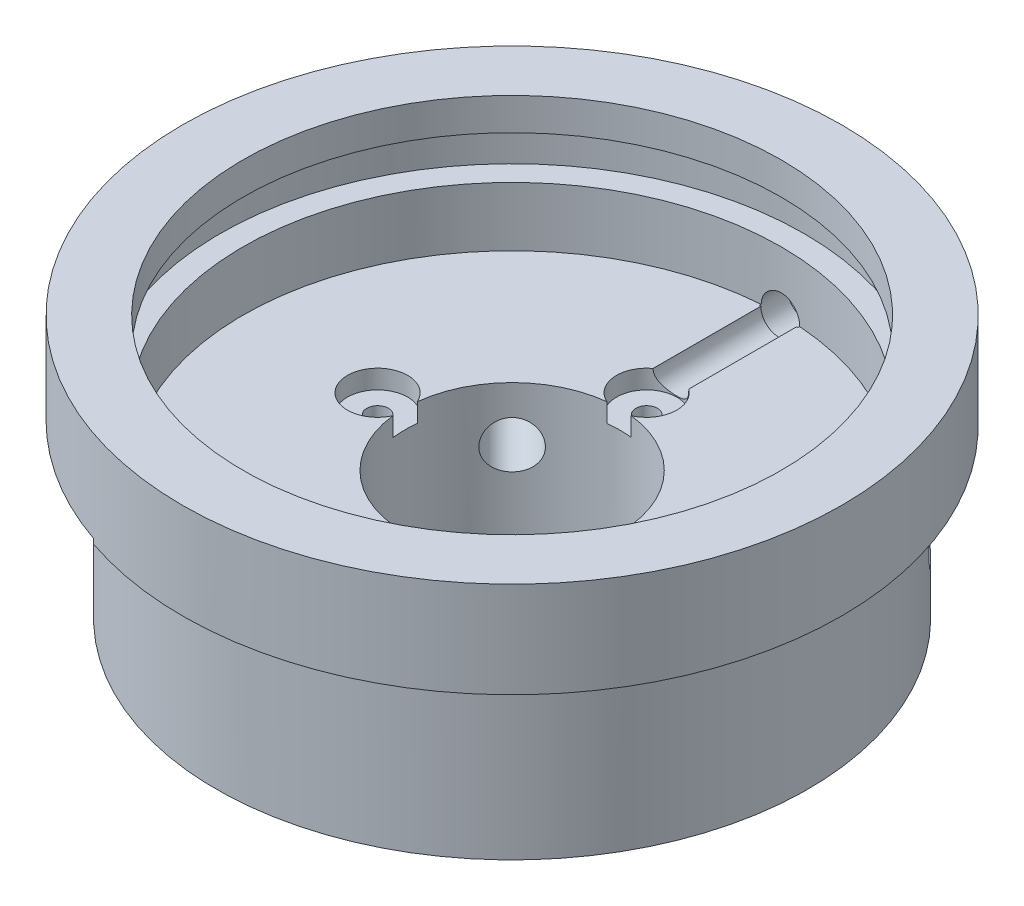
ISO-10303-21;
HEADER;
FILE_DESCRIPTION(('STEP AP214'),'2;1');
FILE_NAME('part.step','',(''),(''),'','','');
FILE_SCHEMA(('AUTOMOTIVE_DESIGN { 1 0 10303 214 1 1 1 1 }'));
ENDSEC;
DATA;
#1=APPLICATION_CONTEXT('core data for automotive mechanical design processes');
#2=APPLICATION_PROTOCOL_DEFINITION('international standard','automotive_design',2000,#1);
#3=PRODUCT_CONTEXT('',#1,'mechanical');
#4=PRODUCT('Part','Part','',(#3));
#5=PRODUCT_RELATED_PRODUCT_CATEGORY('part','',(#4));
#6=PRODUCT_DEFINITION_FORMATION('','',#4);
#7=PRODUCT_DEFINITION_CONTEXT('part definition',#1,'design');
#8=PRODUCT_DEFINITION('design','',#6,#7);
#9=PRODUCT_DEFINITION_SHAPE('','',#8);
#10=(LENGTH_UNIT() NAMED_UNIT(*) SI_UNIT(.MILLI.,.METRE.));
#11=(NAMED_UNIT(*) PLANE_ANGLE_UNIT() SI_UNIT($,.RADIAN.));
#12=(NAMED_UNIT(*) SI_UNIT($,.STERADIAN.) SOLID_ANGLE_UNIT());
#13=UNCERTAINTY_MEASURE_WITH_UNIT(LENGTH_MEASURE(1.E-05),#10,'distance_accuracy_value','');
#14=(GEOMETRIC_REPRESENTATION_CONTEXT(3) GLOBAL_UNCERTAINTY_ASSIGNED_CONTEXT((#13)) GLOBAL_UNIT_ASSIGNED_CONTEXT((#10,
#11,#12)) REPRESENTATION_CONTEXT('',''));
#15=CARTESIAN_POINT('',(0.,0.,0.));
#16=DIRECTION('',(0.,0.,1.));
#17=DIRECTION('',(1.,0.,0.));
#18=AXIS2_PLACEMENT_3D('',#15,#16,#17);
#19=CARTESIAN_POINT('',(0.,-4.445,-31.75));
#20=DIRECTION('',(0.,1.,0.));
#21=DIRECTION('',(0.,0.,1.));
#22=AXIS2_PLACEMENT_3D('',#19,#20,#21);
#23=CYLINDRICAL_SURFACE('',#22,7.112);
#24=CARTESIAN_POINT('',(-4.21640000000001,0.,-26.022652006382));
#25=CARTESIAN_POINT('',(-4.2164235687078,-0.106965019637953,-26.022696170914));
#26=CARTESIAN_POINT('',(-4.21233061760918,-0.213904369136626,-26.0196566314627));
#27=CARTESIAN_POINT('',(-4.19609861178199,-0.426746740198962,-26.007745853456));
#28=CARTESIAN_POINT('',(-4.18396707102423,-0.5326506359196,-25.9988800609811));
#29=CARTESIAN_POINT('',(-4.15197949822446,-0.74175558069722,-25.9757491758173));
#30=CARTESIAN_POINT('',(-4.13218940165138,-0.844971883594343,-25.9615301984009));
#31=CARTESIAN_POINT('',(-4.08519356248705,-1.04889534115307,-25.9282676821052));
#32=CARTESIAN_POINT('',(-4.05798647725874,-1.14960203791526,-25.9092232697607));
#33=CARTESIAN_POINT('',(-3.96597449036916,-1.44630097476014,-25.8460070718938));
#34=CARTESIAN_POINT('',(-3.89063156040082,-1.63780725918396,-25.7956386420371));
#35=CARTESIAN_POINT('',(-3.71439849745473,-2.00576716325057,-25.6841411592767));
#36=CARTESIAN_POINT('',(-3.6134333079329,-2.18217448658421,-25.6229806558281));
#37=CARTESIAN_POINT('',(-3.40870897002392,-2.48718947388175,-25.5072075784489));
#38=CARTESIAN_POINT('',(-3.30874295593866,-2.61867784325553,-25.4534054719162));
#39=CARTESIAN_POINT('',(-3.09476318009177,-2.86832737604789,-25.3455203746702));
#40=CARTESIAN_POINT('',(-2.98082005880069,-2.9865502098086,-25.2914400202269));
#41=CARTESIAN_POINT('',(-2.86012914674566,-3.0980139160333,-25.238456));
#42=B_SPLINE_CURVE_WITH_KNOTS('',3,(#24,#25,#26,#27,#28,#29,#30,#31,#32,#33,#34,#35,#36,#37,#38,
#39,#40,#41),.UNSPECIFIED.,.F.,.F.,(4,2,2,2,2,2,2,2,4),(0.,0.320732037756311,0.641164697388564,
0.958897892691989,1.27668864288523,1.90944595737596,2.54407867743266,3.06417064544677,
3.5817347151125),.UNSPECIFIED.);
#43=CARTESIAN_POINT('',(-4.21640000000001,0.,-26.022652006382));
#44=VERTEX_POINT('',#43);
#45=CARTESIAN_POINT('',(-2.86012914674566,-3.09801391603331,-25.238456));
#46=VERTEX_POINT('',#45);
#47=EDGE_CURVE('E58',#44,#46,#42,.T.);
#48=ORIENTED_EDGE('',*,*,#47,.F.);
#49=CARTESIAN_POINT('',(0.,0.,-31.75));
#50=DIRECTION('',(0.,1.,0.));
#51=DIRECTION('',(0.,0.,1.));
#52=AXIS2_PLACEMENT_3D('',#49,#50,#51);
#53=CIRCLE('',#52,7.112);
#54=CARTESIAN_POINT('',(-2.86012914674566,0.,-25.238456));
#55=VERTEX_POINT('',#54);
#56=EDGE_CURVE('E403',#44,#55,#53,.T.);
#57=ORIENTED_EDGE('',*,*,#56,.T.);
#58=DIRECTION('',(0.,1.,0.));
#59=VECTOR('',#58,1.);
#60=CARTESIAN_POINT('',(-2.86012914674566,-2.2225,-25.238456));
#61=LINE('',#60,#59);
#62=EDGE_CURVE('E405',#55,#46,#61,.F.);
#63=ORIENTED_EDGE('',*,*,#62,.T.);
#64=EDGE_LOOP('',(#48,#57,#63));
#65=FACE_BOUND('',#64,.T.);
#66=ADVANCED_FACE('F35',(#65),#23,.F.);
#67=CARTESIAN_POINT('',(2.86012914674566,-3.0980139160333,-25.238456));
#68=CARTESIAN_POINT('',(2.9473540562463,-3.01747149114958,-25.2767655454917));
#69=CARTESIAN_POINT('',(3.03102165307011,-2.93341976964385,-25.3156111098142));
#70=CARTESIAN_POINT('',(3.19098915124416,-2.75856559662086,-25.3934249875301));
#71=CARTESIAN_POINT('',(3.26728635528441,-2.66776069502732,-25.432393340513));
#72=CARTESIAN_POINT('',(3.48609034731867,-2.38384248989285,-25.5487803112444));
#73=CARTESIAN_POINT('',(3.6167630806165,-2.18083711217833,-25.6248809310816));
#74=CARTESIAN_POINT('',(3.84342517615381,-1.75079189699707,-25.7644721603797));
#75=CARTESIAN_POINT('',(3.93926700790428,-1.52365497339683,-25.8279086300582));
#76=CARTESIAN_POINT('',(4.05259703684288,-1.17034863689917,-25.9054245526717));
#77=CARTESIAN_POINT('',(4.08525422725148,-1.05081811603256,-25.9282853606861));
#78=CARTESIAN_POINT('',(4.14005679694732,-0.808314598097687,-25.9671278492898));
#79=CARTESIAN_POINT('',(4.16221066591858,-0.68534446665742,-25.983115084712));
#80=CARTESIAN_POINT('',(4.19131524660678,-0.468659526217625,-26.0042482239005));
#81=CARTESIAN_POINT('',(4.20069613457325,-0.37542944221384,-26.0111149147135));
#82=CARTESIAN_POINT('',(4.21325076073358,-0.188142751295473,-26.0203335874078));
#83=CARTESIAN_POINT('',(4.21641193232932,-0.0940848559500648,-26.0226764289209));
#84=CARTESIAN_POINT('',(4.21640000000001,0.,-26.022652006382));
#85=B_SPLINE_CURVE_WITH_KNOTS('',3,(#67,#68,#69,#70,#71,#72,#73,#74,#75,#76,#77,#78,#79,#80,#81,
#82,#83,#84),.UNSPECIFIED.,.F.,.F.,(4,2,2,2,2,2,2,2,4),(0.,0.374041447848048,0.748219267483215,
1.5040091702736,2.26296399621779,2.64041544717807,3.01756128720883,3.29911647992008,
3.58123995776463),.UNSPECIFIED.);
#86=CARTESIAN_POINT('',(2.86012914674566,-3.09801391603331,-25.238456));
#87=VERTEX_POINT('',#86);
#88=CARTESIAN_POINT('',(4.21640000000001,0.,-26.022652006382));
#89=VERTEX_POINT('',#88);
#90=EDGE_CURVE('E181',#87,#89,#85,.T.);
#91=ORIENTED_EDGE('',*,*,#90,.F.);
#92=DIRECTION('',(0.,1.,0.));
#93=VECTOR('',#92,1.);
#94=CARTESIAN_POINT('',(2.86012914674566,-2.2225,-25.238456));
#95=LINE('',#94,#93);
#96=CARTESIAN_POINT('',(2.86012914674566,0.,-25.238456));
#97=VERTEX_POINT('',#96);
#98=EDGE_CURVE('E424',#87,#97,#95,.T.);
#99=ORIENTED_EDGE('',*,*,#98,.T.);
#100=EDGE_CURVE('E413',#97,#89,#53,.T.);
#101=ORIENTED_EDGE('',*,*,#100,.T.);
#102=EDGE_LOOP('',(#91,#99,#101));
#103=FACE_BOUND('',#102,.T.);
#104=ADVANCED_FACE('F218',(#103),#23,.F.);
#105=CARTESIAN_POINT('',(31.75,0.,1.10854532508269E-13));
#106=DIRECTION('',(0.,1.,0.));
#107=DIRECTION('',(0.,0.,1.));
#108=AXIS2_PLACEMENT_3D('',#105,#106,#107);
#109=CYLINDRICAL_SURFACE('',#108,2.55269999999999);
#110=CARTESIAN_POINT('',(31.75,-33.401,1.10854532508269E-13));
#111=DIRECTION('',(0.,1.,0.));
#112=DIRECTION('',(0.,0.,1.));
#113=AXIS2_PLACEMENT_3D('',#110,#111,#112);
#114=CIRCLE('',#113,2.55269999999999);
#115=CARTESIAN_POINT('',(31.75,-33.401,2.5527000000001));
#116=VERTEX_POINT('',#115);
#117=EDGE_CURVE('E411',#116,#116,#114,.T.);
#118=ORIENTED_EDGE('',*,*,#117,.F.);
#119=EDGE_LOOP('',(#118));
#120=FACE_BOUND('',#119,.T.);
#121=CARTESIAN_POINT('',(31.75,-4.445,1.10854532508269E-13));
#122=DIRECTION('',(0.,1.,0.));
#123=DIRECTION('',(0.,0.,1.));
#124=AXIS2_PLACEMENT_3D('',#121,#122,#123);
#125=CIRCLE('',#124,2.55269999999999);
#126=CARTESIAN_POINT('',(31.75,-4.445,2.55270000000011));
#127=VERTEX_POINT('',#126);
#128=EDGE_CURVE('E196',#127,#127,#125,.F.);
#129=ORIENTED_EDGE('',*,*,#128,.F.);
#130=EDGE_LOOP('',(#129));
#131=FACE_BOUND('',#130,.T.);
#132=ADVANCED_FACE('F399',(#120,#131),#109,.F.);
#133=CARTESIAN_POINT('',(0.,0.,31.75));
#134=DIRECTION('',(0.,1.,0.));
#135=DIRECTION('',(0.,0.,1.));
#136=AXIS2_PLACEMENT_3D('',#133,#134,#135);
#137=CYLINDRICAL_SURFACE('',#136,2.5527);
#138=CARTESIAN_POINT('',(0.,-33.401,31.75));
#139=DIRECTION('',(0.,1.,0.));
#140=DIRECTION('',(0.,0.,1.));
#141=AXIS2_PLACEMENT_3D('',#138,#139,#140);
#142=CIRCLE('',#141,2.55269999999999);
#143=CARTESIAN_POINT('',(0.,-33.401,34.3027));
#144=VERTEX_POINT('',#143);
#145=EDGE_CURVE('E588',#144,#144,#142,.T.);
#146=ORIENTED_EDGE('',*,*,#145,.F.);
#147=EDGE_LOOP('',(#146));
#148=FACE_BOUND('',#147,.T.);
#149=CARTESIAN_POINT('',(0.,-4.445,31.75));
#150=DIRECTION('',(0.,1.,0.));
#151=DIRECTION('',(0.,0.,1.));
#152=AXIS2_PLACEMENT_3D('',#149,#150,#151);
#153=CIRCLE('',#152,2.5527);
#154=CARTESIAN_POINT('',(0.,-4.445,34.3027));
#155=VERTEX_POINT('',#154);
#156=EDGE_CURVE('E192',#155,#155,#153,.F.);
#157=ORIENTED_EDGE('',*,*,#156,.F.);
#158=EDGE_LOOP('',(#157));
#159=FACE_BOUND('',#158,.T.);
#160=ADVANCED_FACE('F501',(#148,#159),#137,.F.);
#161=CARTESIAN_POINT('',(-31.75,0.,-3.32563597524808E-13));
#162=DIRECTION('',(0.,1.,0.));
#163=DIRECTION('',(0.,0.,1.));
#164=AXIS2_PLACEMENT_3D('',#161,#162,#163);
#165=CYLINDRICAL_SURFACE('',#164,2.55269999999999);
#166=CARTESIAN_POINT('',(-31.75,-33.401,-3.32563597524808E-13));
#167=DIRECTION('',(0.,1.,0.));
#168=DIRECTION('',(0.,0.,1.));
#169=AXIS2_PLACEMENT_3D('',#166,#167,#168);
#170=CIRCLE('',#169,2.55269999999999);
#171=CARTESIAN_POINT('',(-31.75,-33.401,2.55269999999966));
#172=VERTEX_POINT('',#171);
#173=EDGE_CURVE('E585',#172,#172,#170,.T.);
#174=ORIENTED_EDGE('',*,*,#173,.F.);
#175=EDGE_LOOP('',(#174));
#176=FACE_BOUND('',#175,.T.);
#177=CARTESIAN_POINT('',(-31.75,-4.445,-3.32563597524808E-13));
#178=DIRECTION('',(0.,1.,0.));
#179=DIRECTION('',(0.,0.,1.));
#180=AXIS2_PLACEMENT_3D('',#177,#178,#179);
#181=CIRCLE('',#180,2.55269999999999);
#182=CARTESIAN_POINT('',(-31.75,-4.445,2.55269999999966));
#183=VERTEX_POINT('',#182);
#184=EDGE_CURVE('E187',#183,#183,#181,.F.);
#185=ORIENTED_EDGE('',*,*,#184,.F.);
#186=EDGE_LOOP('',(#185));
#187=FACE_BOUND('',#186,.T.);
#188=ADVANCED_FACE('F496',(#176,#187),#165,.F.);
#189=CARTESIAN_POINT('',(0.,0.,-31.75));
#190=DIRECTION('',(0.,1.,0.));
#191=DIRECTION('',(0.,0.,1.));
#192=AXIS2_PLACEMENT_3D('',#189,#190,#191);
#193=CYLINDRICAL_SURFACE('',#192,2.5527);
#194=CARTESIAN_POINT('',(0.,-33.401,-31.75));
#195=DIRECTION('',(0.,1.,0.));
#196=DIRECTION('',(0.,0.,1.));
#197=AXIS2_PLACEMENT_3D('',#194,#195,#196);
#198=CIRCLE('',#197,2.55269999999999);
#199=CARTESIAN_POINT('',(0.,-33.401,-29.1973));
#200=VERTEX_POINT('',#199);
#201=EDGE_CURVE('E428',#200,#200,#198,.T.);
#202=ORIENTED_EDGE('',*,*,#201,.F.);
#203=EDGE_LOOP('',(#202));
#204=FACE_BOUND('',#203,.T.);
#205=CARTESIAN_POINT('',(0.,-4.445,-31.75));
#206=DIRECTION('',(0.,1.,0.));
#207=DIRECTION('',(0.,0.,1.));
#208=AXIS2_PLACEMENT_3D('',#205,#206,#207);
#209=CIRCLE('',#208,2.5527);
#210=CARTESIAN_POINT('',(0.,-4.445,-29.1973));
#211=VERTEX_POINT('',#210);
#212=EDGE_CURVE('E182',#211,#211,#209,.F.);
#213=ORIENTED_EDGE('',*,*,#212,.F.);
#214=EDGE_LOOP('',(#213));
#215=FACE_BOUND('',#214,.T.);
#216=ADVANCED_FACE('F220',(#204,#215),#193,.F.);
#217=CARTESIAN_POINT('',(60.96,-33.401,0.));
#218=DIRECTION('',(0.,-1.,0.));
#219=DIRECTION('',(0.,0.,-1.));
#220=AXIS2_PLACEMENT_3D('',#217,#218,#219);
#221=PLANE('',#220);
#222=ORIENTED_EDGE('',*,*,#173,.T.);
#223=EDGE_LOOP('',(#222));
#224=FACE_BOUND('',#223,.T.);
#225=ORIENTED_EDGE('',*,*,#145,.T.);
#226=EDGE_LOOP('',(#225));
#227=FACE_BOUND('',#226,.T.);
#228=ORIENTED_EDGE('',*,*,#117,.T.);
#229=EDGE_LOOP('',(#228));
#230=FACE_BOUND('',#229,.T.);
#231=ORIENTED_EDGE('',*,*,#201,.T.);
#232=EDGE_LOOP('',(#231));
#233=FACE_BOUND('',#232,.T.);
#234=CARTESIAN_POINT('',(0.,-33.401,0.));
#235=DIRECTION('',(0.,-1.,0.));
#236=DIRECTION('',(0.,0.,-1.));
#237=AXIS2_PLACEMENT_3D('',#234,#235,#236);
#238=CIRCLE('',#237,25.4);
#239=CARTESIAN_POINT('',(0.,-33.401,-25.4));
#240=VERTEX_POINT('',#239);
#241=EDGE_CURVE('E357',#240,#240,#238,.T.);
#242=ORIENTED_EDGE('',*,*,#241,.F.);
#243=EDGE_LOOP('',(#242));
#244=FACE_BOUND('',#243,.T.);
#245=CARTESIAN_POINT('',(0.,-33.401,0.));
#246=DIRECTION('',(0.,-1.,0.));
#247=DIRECTION('',(0.,0.,-1.));
#248=AXIS2_PLACEMENT_3D('',#245,#246,#247);
#249=CIRCLE('',#248,36.703);
#250=CARTESIAN_POINT('',(0.,-33.401,-36.703));
#251=VERTEX_POINT('',#250);
#252=EDGE_CURVE('E431',#251,#251,#249,.T.);
#253=ORIENTED_EDGE('',*,*,#252,.T.);
#254=EDGE_LOOP('',(#253));
#255=FACE_BOUND('',#254,.T.);
#256=ADVANCED_FACE('F384',(#224,#227,#230,#233,#244,#255),#221,.T.);
#257=CARTESIAN_POINT('',(0.,0.,0.));
#258=DIRECTION('',(0.,-1.,0.));
#259=DIRECTION('',(0.,0.,-1.));
#260=AXIS2_PLACEMENT_3D('',#257,#258,#259);
#261=CYLINDRICAL_SURFACE('',#260,63.5);
#262=CARTESIAN_POINT('',(0.,24.13,0.));
#263=DIRECTION('',(0.,-1.,0.));
#264=DIRECTION('',(0.,0.,-1.));
#265=AXIS2_PLACEMENT_3D('',#262,#263,#264);
#266=CIRCLE('',#265,63.5);
#267=CARTESIAN_POINT('',(0.,24.13,-63.5));
#268=VERTEX_POINT('',#267);
#269=EDGE_CURVE('E441',#268,#268,#266,.T.);
#270=ORIENTED_EDGE('',*,*,#269,.T.);
#271=EDGE_LOOP('',(#270));
#272=FACE_BOUND('',#271,.T.);
#273=CARTESIAN_POINT('',(0.,31.75,0.));
#274=DIRECTION('',(0.,-1.,0.));
#275=DIRECTION('',(0.,0.,-1.));
#276=AXIS2_PLACEMENT_3D('',#273,#274,#275);
#277=CIRCLE('',#276,63.5);
#278=CARTESIAN_POINT('',(0.,31.75,-63.5));
#279=VERTEX_POINT('',#278);
#280=EDGE_CURVE('E173',#279,#279,#277,.T.);
#281=ORIENTED_EDGE('',*,*,#280,.F.);
#282=EDGE_LOOP('',(#281));
#283=FACE_BOUND('',#282,.T.);
#284=ADVANCED_FACE('F392',(#272,#283),#261,.F.);
#285=CARTESIAN_POINT('',(63.5,31.75,0.));
#286=DIRECTION('',(0.,1.,0.));
#287=DIRECTION('',(0.,0.,1.));
#288=AXIS2_PLACEMENT_3D('',#285,#286,#287);
#289=PLANE('',#288);
#290=ORIENTED_EDGE('',*,*,#280,.T.);
#291=EDGE_LOOP('',(#290));
#292=FACE_BOUND('',#291,.T.);
#293=CARTESIAN_POINT('',(0.,31.75,0.));
#294=DIRECTION('',(0.,-1.,0.));
#295=DIRECTION('',(0.,0.,-1.));
#296=AXIS2_PLACEMENT_3D('',#293,#294,#295);
#297=CIRCLE('',#296,77.7875);
#298=CARTESIAN_POINT('',(0.,31.75,-77.7875));
#299=VERTEX_POINT('',#298);
#300=EDGE_CURVE('E170',#299,#299,#297,.T.);
#301=ORIENTED_EDGE('',*,*,#300,.F.);
#302=EDGE_LOOP('',(#301));
#303=FACE_BOUND('',#302,.T.);
#304=ADVANCED_FACE('F718',(#292,#303),#289,.T.);
#305=CARTESIAN_POINT('',(0.,0.,0.));
#306=DIRECTION('',(0.,-1.,0.));
#307=DIRECTION('',(0.,0.,-1.));
#308=AXIS2_PLACEMENT_3D('',#305,#306,#307);
#309=CYLINDRICAL_SURFACE('',#308,77.7875);
#310=DIRECTION('',(0.,-1.,0.));
#311=VECTOR('',#310,1.);
#312=CARTESIAN_POINT('',(-25.185286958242,0.,73.5975303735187));
#313=LINE('',#312,#311);
#314=CARTESIAN_POINT('',(-25.185286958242,9.144,73.5975303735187));
#315=VERTEX_POINT('',#314);
#316=CARTESIAN_POINT('',(-25.185286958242,10.287,73.5975303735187));
#317=VERTEX_POINT('',#316);
#318=EDGE_CURVE('E156',#315,#317,#313,.F.);
#319=ORIENTED_EDGE('',*,*,#318,.F.);
#320=CARTESIAN_POINT('',(0.,9.144,0.));
#321=DIRECTION('',(0.,-1.,0.));
#322=DIRECTION('',(0.,0.,-1.));
#323=AXIS2_PLACEMENT_3D('',#320,#321,#322);
#324=CIRCLE('',#323,77.7875);
#325=CARTESIAN_POINT('',(-73.5975303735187,9.144,25.185286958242));
#326=VERTEX_POINT('',#325);
#327=EDGE_CURVE('E162',#326,#315,#324,.T.);
#328=ORIENTED_EDGE('',*,*,#327,.F.);
#329=DIRECTION('',(0.,-1.,0.));
#330=VECTOR('',#329,1.);
#331=CARTESIAN_POINT('',(-73.5975303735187,0.,25.185286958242));
#332=LINE('',#331,#330);
#333=CARTESIAN_POINT('',(-73.5975303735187,10.287,25.185286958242));
#334=VERTEX_POINT('',#333);
#335=EDGE_CURVE('E150',#334,#326,#332,.T.);
#336=ORIENTED_EDGE('',*,*,#335,.F.);
#337=CARTESIAN_POINT('',(0.,10.287,0.));
#338=DIRECTION('',(0.,-1.,0.));
#339=DIRECTION('',(0.,0.,-1.));
#340=AXIS2_PLACEMENT_3D('',#337,#338,#339);
#341=CIRCLE('',#340,77.7875);
#342=EDGE_CURVE('E11',#334,#317,#341,.F.);
#343=ORIENTED_EDGE('',*,*,#342,.T.);
#344=EDGE_LOOP('',(#319,#328,#336,#343));
#345=FACE_BOUND('',#344,.T.);
#346=ORIENTED_EDGE('',*,*,#300,.T.);
#347=EDGE_LOOP('',(#346));
#348=FACE_BOUND('',#347,.T.);
#349=ADVANCED_FACE('F168',(#345,#348),#309,.T.);
#350=CARTESIAN_POINT('',(77.7875,9.144,0.));
#351=DIRECTION('',(0.,-1.,0.));
#352=DIRECTION('',(0.,0.,-1.));
#353=AXIS2_PLACEMENT_3D('',#350,#351,#352);
#354=PLANE('',#353);
#355=DIRECTION('',(0.707106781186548,0.,0.707106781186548));
#356=VECTOR('',#355,1.);
#357=CARTESIAN_POINT('',(-85.312433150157,9.144,13.4703841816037));
#358=LINE('',#357,#356);
#359=CARTESIAN_POINT('',(-49.3914086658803,9.144,49.3914086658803));
#360=VERTEX_POINT('',#359);
#361=EDGE_CURVE('E50',#326,#360,#358,.T.);
#362=ORIENTED_EDGE('',*,*,#361,.F.);
#363=ORIENTED_EDGE('',*,*,#327,.T.);
#364=EDGE_CURVE('E165',#360,#315,#358,.T.);
#365=ORIENTED_EDGE('',*,*,#364,.F.);
#366=CARTESIAN_POINT('',(0.,9.144,0.));
#367=DIRECTION('',(0.,-1.,0.));
#368=DIRECTION('',(0.,0.,-1.));
#369=AXIS2_PLACEMENT_3D('',#366,#367,#368);
#370=CIRCLE('',#369,69.85);
#371=EDGE_CURVE('E164',#360,#360,#370,.T.);
#372=ORIENTED_EDGE('',*,*,#371,.F.);
#373=EDGE_LOOP('',(#362,#363,#365,#372));
#374=FACE_BOUND('',#373,.T.);
#375=ADVANCED_FACE('F161',(#374),#354,.T.);
#376=CARTESIAN_POINT('',(0.,0.,0.));
#377=DIRECTION('',(0.,-1.,0.));
#378=DIRECTION('',(0.,0.,-1.));
#379=AXIS2_PLACEMENT_3D('',#376,#377,#378);
#380=CYLINDRICAL_SURFACE('',#379,69.85);
#381=CARTESIAN_POINT('',(-51.5771450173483,-18.0813445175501,-47.104358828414));
#382=CARTESIAN_POINT('',(-51.6791972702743,-17.9922589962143,-46.9926165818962));
#383=CARTESIAN_POINT('',(-51.7783381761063,-17.8968041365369,-46.883331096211));
#384=CARTESIAN_POINT('',(-51.9702689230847,-17.693789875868,-46.6704851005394));
#385=CARTESIAN_POINT('',(-52.0630571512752,-17.5862274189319,-46.5669260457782));
#386=CARTESIAN_POINT('',(-52.2417838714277,-17.3596942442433,-46.3663303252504));
#387=CARTESIAN_POINT('',(-52.3277164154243,-17.240713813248,-46.2692993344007));
#388=CARTESIAN_POINT('',(-52.492189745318,-16.9922210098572,-46.082621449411));
#389=CARTESIAN_POINT('',(-52.5707278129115,-16.8627047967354,-45.9929772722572));
#390=CARTESIAN_POINT('',(-52.7198772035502,-16.5942121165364,-45.8219370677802));
#391=CARTESIAN_POINT('',(-52.7904952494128,-16.4552438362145,-45.7405340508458));
#392=CARTESIAN_POINT('',(-52.9235238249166,-16.1686773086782,-45.5865493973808));
#393=CARTESIAN_POINT('',(-52.9859313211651,-16.0210759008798,-45.5139710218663));
#394=CARTESIAN_POINT('',(-53.1021389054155,-15.7184267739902,-45.3783353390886));
#395=CARTESIAN_POINT('',(-53.1559442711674,-15.5633836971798,-45.3152721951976));
#396=CARTESIAN_POINT('',(-53.2547286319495,-15.246805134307,-45.1991393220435));
#397=CARTESIAN_POINT('',(-53.2997043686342,-15.085267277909,-45.1460732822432));
#398=CARTESIAN_POINT('',(-53.3805579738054,-14.7569457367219,-45.0504434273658));
#399=CARTESIAN_POINT('',(-53.4164384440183,-14.5901635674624,-45.0078766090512));
#400=CARTESIAN_POINT('',(-53.4789435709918,-14.2524324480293,-44.9335893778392));
#401=CARTESIAN_POINT('',(-53.5055648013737,-14.0814819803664,-44.9018729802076));
#402=CARTESIAN_POINT('',(-53.5493875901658,-13.7367531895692,-44.8496014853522));
#403=CARTESIAN_POINT('',(-53.5665924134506,-13.5629758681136,-44.8290425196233));
#404=CARTESIAN_POINT('',(-53.5915124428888,-13.2137128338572,-44.7992485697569));
#405=CARTESIAN_POINT('',(-53.599224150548,-13.0382265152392,-44.7900177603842));
#406=CARTESIAN_POINT('',(-53.6050972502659,-12.6874021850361,-44.7829886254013));
#407=CARTESIAN_POINT('',(-53.6032877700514,-12.5120653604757,-44.7851554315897));
#408=CARTESIAN_POINT('',(-53.590193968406,-12.1621921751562,-44.8008226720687));
#409=CARTESIAN_POINT('',(-53.5789061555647,-11.9876561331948,-44.8143272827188));
#410=CARTESIAN_POINT('',(-53.5469100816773,-11.6407429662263,-44.8525534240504));
#411=CARTESIAN_POINT('',(-53.5262053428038,-11.4683650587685,-44.877270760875));
#412=CARTESIAN_POINT('',(-53.475491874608,-11.1269164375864,-44.9376878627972));
#413=CARTESIAN_POINT('',(-53.4454797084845,-10.9578469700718,-44.9733916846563));
#414=CARTESIAN_POINT('',(-53.3417238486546,-10.4576954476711,-45.0965049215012));
#415=CARTESIAN_POINT('',(-53.2542120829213,-10.1331423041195,-45.1999750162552));
#416=CARTESIAN_POINT('',(-53.0443801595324,-9.51148066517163,-45.4460358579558));
#417=CARTESIAN_POINT('',(-52.922059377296,-9.21437266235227,-45.5886273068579));
#418=CARTESIAN_POINT('',(-52.6447985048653,-8.65497253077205,-45.9085230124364));
#419=CARTESIAN_POINT('',(-52.489774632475,-8.39277270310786,-46.0859163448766));
#420=CARTESIAN_POINT('',(-52.1507139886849,-7.91156317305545,-46.4692463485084));
#421=CARTESIAN_POINT('',(-51.966676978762,-7.6925538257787,-46.6751832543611));
#422=CARTESIAN_POINT('',(-51.5736791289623,-7.30379488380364,-47.1090619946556));
#423=CARTESIAN_POINT('',(-51.364699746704,-7.13408226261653,-47.337020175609));
#424=CARTESIAN_POINT('',(-50.9270366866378,-6.84904756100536,-47.8075574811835));
#425=CARTESIAN_POINT('',(-50.6983534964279,-6.73372413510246,-48.0501362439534));
#426=CARTESIAN_POINT('',(-50.2280761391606,-6.56115659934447,-48.5415083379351));
#427=CARTESIAN_POINT('',(-49.9865320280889,-6.50370249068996,-48.7902758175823));
#428=CARTESIAN_POINT('',(-49.4963668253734,-6.44782932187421,-49.2874629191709));
#429=CARTESIAN_POINT('',(-49.2477459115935,-6.44940877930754,-49.5358825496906));
#430=CARTESIAN_POINT('',(-48.7514707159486,-6.51143663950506,-50.0243682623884));
#431=CARTESIAN_POINT('',(-48.5038162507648,-6.5716679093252,-50.264461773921));
#432=CARTESIAN_POINT('',(-48.015882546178,-6.74891927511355,-50.730774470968));
#433=CARTESIAN_POINT('',(-47.7756033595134,-6.86593977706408,-50.9569935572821));
#434=CARTESIAN_POINT('',(-47.3094665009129,-7.15357512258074,-51.3900605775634));
#435=CARTESIAN_POINT('',(-47.0836274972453,-7.32425771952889,-51.5968835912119));
#436=CARTESIAN_POINT('',(-46.6538003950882,-7.71430634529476,-51.9858592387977));
#437=CARTESIAN_POINT('',(-46.4498129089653,-7.93367373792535,-52.1680111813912));
#438=CARTESIAN_POINT('',(-46.0694169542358,-8.41600115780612,-52.5042492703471));
#439=CARTESIAN_POINT('',(-45.8931360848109,-8.67915200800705,-52.6582060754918));
#440=CARTESIAN_POINT('',(-45.5751425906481,-9.24093634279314,-52.9336685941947));
#441=CARTESIAN_POINT('',(-45.4334303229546,-9.53957019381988,-53.0551739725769));
#442=CARTESIAN_POINT('',(-45.1892044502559,-10.1644871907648,-53.263347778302));
#443=CARTESIAN_POINT('',(-45.0867625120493,-10.4908195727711,-53.3499525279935));
#444=CARTESIAN_POINT('',(-44.9250519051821,-11.1614058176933,-53.4861989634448));
#445=CARTESIAN_POINT('',(-44.8657825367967,-11.5056593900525,-53.5358412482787));
#446=CARTESIAN_POINT('',(-44.7926182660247,-12.201485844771,-53.5970722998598));
#447=CARTESIAN_POINT('',(-44.7786217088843,-12.553040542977,-53.6087463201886));
#448=CARTESIAN_POINT('',(-44.7962284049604,-13.2542148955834,-53.5940345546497));
#449=CARTESIAN_POINT('',(-44.8278311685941,-13.603834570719,-53.5676491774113));
#450=CARTESIAN_POINT('',(-44.9353841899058,-14.2905849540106,-53.477458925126));
#451=CARTESIAN_POINT('',(-45.011263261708,-14.6277347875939,-53.4137141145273));
#452=CARTESIAN_POINT('',(-45.2047400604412,-15.2808172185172,-53.2500695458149));
#453=CARTESIAN_POINT('',(-45.3223385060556,-15.5967494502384,-53.1501691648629));
#454=CARTESIAN_POINT('',(-45.5268756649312,-16.0479915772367,-52.9748441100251));
#455=CARTESIAN_POINT('',(-45.5998769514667,-16.1948352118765,-52.9120418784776));
#456=CARTESIAN_POINT('',(-45.7546525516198,-16.4799004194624,-52.7782601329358));
#457=CARTESIAN_POINT('',(-45.8364236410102,-16.6181251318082,-52.7072836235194));
#458=CARTESIAN_POINT('',(-46.0080888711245,-16.8850307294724,-52.5575040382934));
#459=CARTESIAN_POINT('',(-46.0979861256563,-17.0137079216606,-52.4786979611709));
#460=CARTESIAN_POINT('',(-46.2850975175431,-17.2605208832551,-52.3137438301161));
#461=CARTESIAN_POINT('',(-46.3823089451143,-17.3786605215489,-52.2275984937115));
#462=CARTESIAN_POINT('',(-46.5835116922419,-17.603872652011,-52.0482193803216));
#463=CARTESIAN_POINT('',(-46.6875182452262,-17.7109187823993,-51.9549695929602));
#464=CARTESIAN_POINT('',(-46.901220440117,-17.9128274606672,-51.7621359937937));
#465=CARTESIAN_POINT('',(-47.010913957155,-18.0076945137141,-51.6625545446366));
#466=CARTESIAN_POINT('',(-47.2351794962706,-18.1846379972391,-51.4575883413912));
#467=CARTESIAN_POINT('',(-47.3497530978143,-18.2667102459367,-51.3522017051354));
#468=CARTESIAN_POINT('',(-47.5827906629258,-18.4174037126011,-51.13634465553));
#469=CARTESIAN_POINT('',(-47.7012531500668,-18.4860299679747,-51.0258761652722));
#470=CARTESIAN_POINT('',(-47.9409267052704,-18.6092386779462,-50.8007580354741));
#471=CARTESIAN_POINT('',(-48.0621314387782,-18.6638504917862,-50.6861177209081));
#472=CARTESIAN_POINT('',(-48.3065514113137,-18.7588020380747,-50.4532265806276));
#473=CARTESIAN_POINT('',(-48.429765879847,-18.7991471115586,-50.3349771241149));
#474=CARTESIAN_POINT('',(-48.6773877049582,-18.8653159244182,-50.0955497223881));
#475=CARTESIAN_POINT('',(-48.801795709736,-18.8911312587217,-49.9743701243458));
#476=CARTESIAN_POINT('',(-49.0507603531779,-18.9280067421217,-49.7300293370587));
#477=CARTESIAN_POINT('',(-49.1753169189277,-18.9390724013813,-49.6068689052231));
#478=CARTESIAN_POINT('',(-49.423268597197,-18.9463712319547,-49.359837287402));
#479=CARTESIAN_POINT('',(-49.5466662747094,-18.9426575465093,-49.2359702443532));
#480=CARTESIAN_POINT('',(-49.7918304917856,-18.9205491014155,-48.9880240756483));
#481=CARTESIAN_POINT('',(-49.9135976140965,-18.9021597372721,-48.8639450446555));
#482=CARTESIAN_POINT('',(-50.1546073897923,-18.8508610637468,-48.616536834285));
#483=CARTESIAN_POINT('',(-50.2738520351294,-18.8179636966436,-48.4932071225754));
#484=CARTESIAN_POINT('',(-50.5090784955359,-18.7379088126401,-48.2481538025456));
#485=CARTESIAN_POINT('',(-50.6250611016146,-18.6907547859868,-48.1264298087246));
#486=CARTESIAN_POINT('',(-50.8863893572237,-18.5666831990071,-47.8502223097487));
#487=CARTESIAN_POINT('',(-51.0304106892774,-18.4850946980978,-47.6965608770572));
#488=CARTESIAN_POINT('',(-51.3102696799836,-18.2996193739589,-47.3953690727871));
#489=CARTESIAN_POINT('',(-51.4461073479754,-18.1957325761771,-47.2478386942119));
#490=CARTESIAN_POINT('',(-51.5771450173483,-18.0813445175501,-47.104358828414));
#491=B_SPLINE_CURVE_WITH_KNOTS('',3,(#381,#382,#383,#384,#385,#386,#387,#388,#389,#390,#391,
#392,#393,#394,#395,#396,#397,#398,#399,#400,#401,#402,#403,#404,#405,#406,#407,#408,#409,#410,
#411,#412,#413,#414,#415,#416,#417,#418,#419,#420,#421,#422,#423,#424,#425,#426,#427,#428,#429,
#430,#431,#432,#433,#434,#435,#436,#437,#438,#439,#440,#441,#442,#443,#444,#445,#446,#447,#448,
#449,#450,#451,#452,#453,#454,#455,#456,#457,#458,#459,#460,#461,#462,#463,#464,#465,#466,#467,
#468,#469,#470,#471,#472,#473,#474,#475,#476,#477,#478,#479,#480,#481,#482,#483,#484,#485,#486,
#487,#488,#489,#490),.UNSPECIFIED.,.T.,.F.,(4,2,2,2,2,2,2,2,2,2,2,2,2,2,2,2,2,2,2,2,2,2,2,2,2,2,
2,2,2,2,2,2,2,2,2,2,2,2,2,2,2,2,2,2,2,2,2,2,2,2,2,2,2,2,4),(0.,0.526618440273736,
1.05337009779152,1.58057390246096,2.10797076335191,2.63491650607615,3.16205638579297,
3.68887159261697,4.21588084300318,4.74273917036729,5.26979225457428,5.79666248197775,
6.32372681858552,6.84917967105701,7.37482616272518,7.90027621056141,8.42592051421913,
9.47562885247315,10.5253560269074,11.5778058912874,12.6302644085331,13.6835102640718,
14.7367300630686,15.7861139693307,16.8354715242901,17.8809589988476,18.9264539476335,
19.9732742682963,21.0201239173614,22.0716617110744,23.1232103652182,24.1766690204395,
25.2301106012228,26.2811851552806,27.3322484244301,28.3816264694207,29.4310225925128,
29.9573211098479,30.4834267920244,31.0097349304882,31.5358490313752,32.0631859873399,
32.5903273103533,33.1176405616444,33.644755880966,34.1707577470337,34.6965624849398,
35.2226710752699,35.7485830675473,36.2726057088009,36.7964357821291,37.3198354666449,
37.8431071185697,38.5192992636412,39.1954906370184),.UNSPECIFIED.);
#492=CARTESIAN_POINT('',(-51.5771450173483,-18.0813445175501,-47.104358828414));
#493=VERTEX_POINT('',#492);
#494=EDGE_CURVE('E43',#493,#493,#491,.T.);
#495=ORIENTED_EDGE('',*,*,#494,.F.);
#496=EDGE_LOOP('',(#495));
#497=FACE_BOUND('',#496,.T.);
#498=CARTESIAN_POINT('',(45.8549158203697,-16.6445462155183,-52.6910732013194));
#499=CARTESIAN_POINT('',(45.7712527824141,-16.5085973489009,-52.7638818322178));
#500=CARTESIAN_POINT('',(45.6917448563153,-16.3679996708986,-52.8327243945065));
#501=CARTESIAN_POINT('',(45.541659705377,-16.078417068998,-52.9621520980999));
#502=CARTESIAN_POINT('',(45.4710846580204,-15.9294301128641,-53.0227352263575));
#503=CARTESIAN_POINT('',(45.3394488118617,-15.6240382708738,-53.1353403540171));
#504=CARTESIAN_POINT('',(45.2783957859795,-15.4676274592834,-53.1873553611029));
#505=CARTESIAN_POINT('',(45.1663811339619,-15.1485448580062,-53.2825104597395));
#506=CARTESIAN_POINT('',(45.1154231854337,-14.9858708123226,-53.3256473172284));
#507=CARTESIAN_POINT('',(45.0241074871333,-14.655585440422,-53.4027697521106));
#508=CARTESIAN_POINT('',(44.9837423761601,-14.4879776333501,-53.4367616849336));
#509=CARTESIAN_POINT('',(44.9139110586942,-14.1488443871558,-53.4954687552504));
#510=CARTESIAN_POINT('',(44.8844488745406,-13.9773175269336,-53.5201804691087));
#511=CARTESIAN_POINT('',(44.8367229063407,-13.631734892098,-53.5601694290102));
#512=CARTESIAN_POINT('',(44.8184522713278,-13.4576807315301,-53.575452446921));
#513=CARTESIAN_POINT('',(44.7932407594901,-13.1081179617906,-53.5965330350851));
#514=CARTESIAN_POINT('',(44.786304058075,-12.9326088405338,-53.6023271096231));
#515=CARTESIAN_POINT('',(44.7838388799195,-12.5818596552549,-53.6043867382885));
#516=CARTESIAN_POINT('',(44.7882841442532,-12.4066199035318,-53.6006742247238));
#517=CARTESIAN_POINT('',(44.8084912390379,-12.0571875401,-53.5837828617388));
#518=CARTESIAN_POINT('',(44.8242572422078,-11.8829953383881,-53.570600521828));
#519=CARTESIAN_POINT('',(44.8669618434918,-11.5370206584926,-53.5348392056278));
#520=CARTESIAN_POINT('',(44.8938967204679,-11.3652373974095,-53.5122633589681));
#521=CARTESIAN_POINT('',(44.9587101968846,-11.0251776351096,-53.4578213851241));
#522=CARTESIAN_POINT('',(44.9965928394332,-10.8569024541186,-53.4259518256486));
#523=CARTESIAN_POINT('',(45.0829357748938,-10.5252195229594,-53.3531122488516));
#524=CARTESIAN_POINT('',(45.1313894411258,-10.3618087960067,-53.312147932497));
#525=CARTESIAN_POINT('',(45.238480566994,-10.0408413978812,-53.2213050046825));
#526=CARTESIAN_POINT('',(45.2971217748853,-9.88328690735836,-53.1714231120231));
#527=CARTESIAN_POINT('',(45.4240536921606,-9.57524873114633,-53.0630266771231));
#528=CARTESIAN_POINT('',(45.4923409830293,-9.42476256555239,-53.0045151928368));
#529=CARTESIAN_POINT('',(45.6379875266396,-9.13184484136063,-52.8791626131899));
#530=CARTESIAN_POINT('',(45.7153501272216,-8.98941628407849,-52.8123184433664));
#531=CARTESIAN_POINT('',(45.9604854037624,-8.57514392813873,-52.5994592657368));
#532=CARTESIAN_POINT('',(46.1411030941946,-8.31680232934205,-52.4412892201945));
#533=CARTESIAN_POINT('',(46.5301718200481,-7.84415026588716,-52.0963824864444));
#534=CARTESIAN_POINT('',(46.7386229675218,-7.62983997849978,-51.9096456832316));
#535=CARTESIAN_POINT('',(47.1768038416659,-7.25105098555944,-51.5117380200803));
#536=CARTESIAN_POINT('',(47.4065448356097,-7.08659886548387,-51.300554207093));
#537=CARTESIAN_POINT('',(47.8798946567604,-6.81249595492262,-50.8590486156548));
#538=CARTESIAN_POINT('',(48.1235031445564,-6.70284382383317,-50.6287273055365));
#539=CARTESIAN_POINT('',(48.616139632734,-6.54184512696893,-50.155852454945));
#540=CARTESIAN_POINT('',(48.8651435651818,-6.49027893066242,-49.9133486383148));
#541=CARTESIAN_POINT('',(49.3620737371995,-6.44622788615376,-49.4219612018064));
#542=CARTESIAN_POINT('',(49.6100000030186,-6.45374159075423,-49.1730777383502));
#543=CARTESIAN_POINT('',(50.0968633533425,-6.52749272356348,-48.676967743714));
#544=CARTESIAN_POINT('',(50.3358290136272,-6.59352330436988,-48.4297384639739));
#545=CARTESIAN_POINT('',(50.7992754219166,-6.78209724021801,-47.9433939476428));
#546=CARTESIAN_POINT('',(51.0237560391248,-6.90464110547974,-47.7042787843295));
#547=CARTESIAN_POINT('',(51.4528695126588,-7.20293993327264,-47.2411329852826));
#548=CARTESIAN_POINT('',(51.6574713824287,-7.37877626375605,-47.0171260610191));
#549=CARTESIAN_POINT('',(52.0415417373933,-7.77858838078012,-46.5916591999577));
#550=CARTESIAN_POINT('',(52.2210095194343,-8.00256551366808,-46.3901998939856));
#551=CARTESIAN_POINT('',(52.5514846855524,-8.49346293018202,-46.0155058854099));
#552=CARTESIAN_POINT('',(52.7023609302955,-8.76057115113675,-45.8424017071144));
#553=CARTESIAN_POINT('',(52.9713556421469,-9.32948337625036,-45.5313123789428));
#554=CARTESIAN_POINT('',(53.0894738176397,-9.63128768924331,-45.3933275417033));
#555=CARTESIAN_POINT('',(53.2906137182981,-10.2615953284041,-45.1570284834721));
#556=CARTESIAN_POINT('',(53.3735796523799,-10.5901401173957,-45.0587773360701));
#557=CARTESIAN_POINT('',(53.5024136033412,-11.2641860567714,-44.9057271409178));
#558=CARTESIAN_POINT('',(53.5482822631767,-11.6096869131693,-44.8509273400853));
#559=CARTESIAN_POINT('',(53.601913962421,-12.3069682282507,-44.7868183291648));
#560=CARTESIAN_POINT('',(53.6097663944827,-12.6587320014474,-44.7774024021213));
#561=CARTESIAN_POINT('',(53.58744643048,-13.3593098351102,-44.8041111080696));
#562=CARTESIAN_POINT('',(53.5572743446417,-13.7081239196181,-44.8402353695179));
#563=CARTESIAN_POINT('',(53.4595987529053,-14.392384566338,-44.9566402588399));
#564=CARTESIAN_POINT('',(53.3921490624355,-14.7278496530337,-45.036857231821));
#565=CARTESIAN_POINT('',(53.2213331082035,-15.3764916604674,-45.2385847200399));
#566=CARTESIAN_POINT('',(53.1179662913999,-15.6896682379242,-45.3600958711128));
#567=CARTESIAN_POINT('',(52.8772542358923,-16.285530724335,-45.6404712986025));
#568=CARTESIAN_POINT('',(52.7398378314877,-16.5681509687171,-45.7994137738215));
#569=CARTESIAN_POINT('',(52.4339520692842,-17.094326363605,-46.149288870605));
#570=CARTESIAN_POINT('',(52.2654822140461,-17.3378808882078,-46.3402220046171));
#571=CARTESIAN_POINT('',(51.9924398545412,-17.6686894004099,-46.6457663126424));
#572=CARTESIAN_POINT('',(51.8978870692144,-17.7733291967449,-46.7509685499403));
#573=CARTESIAN_POINT('',(51.7025427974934,-17.9703201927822,-46.9669109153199));
#574=CARTESIAN_POINT('',(51.6017536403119,-18.0626759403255,-47.077648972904));
#575=CARTESIAN_POINT('',(51.3944993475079,-18.2344634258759,-47.3038209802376));
#576=CARTESIAN_POINT('',(51.2880321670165,-18.3138904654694,-47.4192566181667));
#577=CARTESIAN_POINT('',(51.0701492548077,-18.4591887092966,-47.6538347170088));
#578=CARTESIAN_POINT('',(50.9587353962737,-18.525064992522,-47.7729757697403));
#579=CARTESIAN_POINT('',(50.7318871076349,-18.6426837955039,-48.0138046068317));
#580=CARTESIAN_POINT('',(50.6164621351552,-18.6944573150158,-48.1354861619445));
#581=CARTESIAN_POINT('',(50.3821580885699,-18.7836681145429,-48.3806716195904));
#582=CARTESIAN_POINT('',(50.2632803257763,-18.8211107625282,-48.5041748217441));
#583=CARTESIAN_POINT('',(50.0227928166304,-18.8814207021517,-48.7521541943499));
#584=CARTESIAN_POINT('',(49.9011822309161,-18.9042834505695,-48.8766306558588));
#585=CARTESIAN_POINT('',(49.6561526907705,-18.9352401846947,-49.1255482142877));
#586=CARTESIAN_POINT('',(49.532734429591,-18.9433396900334,-49.2499893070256));
#587=CARTESIAN_POINT('',(49.2854250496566,-18.9447240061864,-49.4974732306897));
#588=CARTESIAN_POINT('',(49.1615378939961,-18.9380689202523,-49.6205196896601));
#589=CARTESIAN_POINT('',(48.9137318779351,-18.9101213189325,-49.8648131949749));
#590=CARTESIAN_POINT('',(48.7898130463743,-18.8888342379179,-49.9860608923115));
#591=CARTESIAN_POINT('',(48.5427337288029,-18.8317673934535,-50.2260408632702));
#592=CARTESIAN_POINT('',(48.4195737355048,-18.7959790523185,-50.3447716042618));
#593=CARTESIAN_POINT('',(48.1750520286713,-18.7101868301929,-50.578804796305));
#594=CARTESIAN_POINT('',(48.0536896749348,-18.6601881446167,-50.6941084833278));
#595=CARTESIAN_POINT('',(47.8135738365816,-18.5463022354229,-50.9206433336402));
#596=CARTESIAN_POINT('',(47.6948217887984,-18.4824075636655,-51.0318722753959));
#597=CARTESIAN_POINT('',(47.4609524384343,-18.3412331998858,-51.2494487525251));
#598=CARTESIAN_POINT('',(47.3458338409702,-18.2639583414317,-51.3557980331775));
#599=CARTESIAN_POINT('',(47.1201719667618,-18.0966242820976,-51.5629259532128));
#600=CARTESIAN_POINT('',(47.0096251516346,-18.0065752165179,-51.6637089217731));
#601=CARTESIAN_POINT('',(46.7939181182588,-17.8143212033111,-51.859164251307));
#602=CARTESIAN_POINT('',(46.6887566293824,-17.7121191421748,-51.9538380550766));
#603=CARTESIAN_POINT('',(46.452916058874,-17.4627139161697,-52.1649431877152));
#604=CARTESIAN_POINT('',(46.3244468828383,-17.3113886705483,-52.2790078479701));
#605=CARTESIAN_POINT('',(46.079939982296,-16.9908540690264,-52.4946495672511));
#606=CARTESIAN_POINT('',(45.9639023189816,-16.8216446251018,-52.596226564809));
#607=CARTESIAN_POINT('',(45.8549158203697,-16.6445462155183,-52.6910732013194));
#608=B_SPLINE_CURVE_WITH_KNOTS('',3,(#498,#499,#500,#501,#502,#503,#504,#505,#506,#507,#508,
#509,#510,#511,#512,#513,#514,#515,#516,#517,#518,#519,#520,#521,#522,#523,#524,#525,#526,#527,
#528,#529,#530,#531,#532,#533,#534,#535,#536,#537,#538,#539,#540,#541,#542,#543,#544,#545,#546,
#547,#548,#549,#550,#551,#552,#553,#554,#555,#556,#557,#558,#559,#560,#561,#562,#563,#564,#565,
#566,#567,#568,#569,#570,#571,#572,#573,#574,#575,#576,#577,#578,#579,#580,#581,#582,#583,#584,
#585,#586,#587,#588,#589,#590,#591,#592,#593,#594,#595,#596,#597,#598,#599,#600,#601,#602,#603,
#604,#605,#606,#607),.UNSPECIFIED.,.T.,.F.,(4,2,2,2,2,2,2,2,2,2,2,2,2,2,2,2,2,2,2,2,2,2,2,2,2,2,
2,2,2,2,2,2,2,2,2,2,2,2,2,2,2,2,2,2,2,2,2,2,2,2,2,2,2,2,4),(0.,0.526151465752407,
1.0524309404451,1.5791377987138,2.10603618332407,2.63256743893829,3.15929275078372,
3.68569530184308,4.21229173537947,4.73767437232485,5.26325075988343,5.78865218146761,
6.31424788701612,6.83951505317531,7.36497588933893,7.89025097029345,8.41572043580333,
9.46830729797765,10.5208983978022,11.5740497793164,12.6271753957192,13.676305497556,
14.725409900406,15.7708206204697,16.8162407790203,17.8632652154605,18.9103189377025,
19.9620646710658,21.0138197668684,22.0672379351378,23.1206378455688,24.1715595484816,
25.2224726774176,26.2718726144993,27.3212887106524,28.3729169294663,29.4245619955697,
29.9518871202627,30.4790164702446,31.0063369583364,31.5334594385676,32.0594137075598,
32.5851707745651,33.1110915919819,33.6368157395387,34.1604022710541,34.6837944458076,
35.2074966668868,35.7310076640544,36.2547999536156,36.7784034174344,37.3015937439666,
37.8246600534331,38.5100657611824,39.1954748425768),.UNSPECIFIED.);
#609=CARTESIAN_POINT('',(45.8549158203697,-16.6445462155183,-52.6910732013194));
#610=VERTEX_POINT('',#609);
#611=EDGE_CURVE('E281',#610,#610,#608,.T.);
#612=ORIENTED_EDGE('',*,*,#611,.F.);
#613=EDGE_LOOP('',(#612));
#614=FACE_BOUND('',#613,.T.);
#615=CARTESIAN_POINT('',(-3.39608310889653,-3.31034947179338,-69.7673929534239));
#616=CARTESIAN_POINT('',(-3.58189868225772,-3.11931702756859,-69.7583480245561));
#617=CARTESIAN_POINT('',(-3.75170813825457,-2.91245303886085,-69.7493369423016));
#618=CARTESIAN_POINT('',(-4.05434232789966,-2.47295550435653,-69.7324022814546));
#619=CARTESIAN_POINT('',(-4.18712382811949,-2.24029227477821,-69.7244799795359));
#620=CARTESIAN_POINT('',(-4.41172402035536,-1.75600421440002,-69.7106297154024));
#621=CARTESIAN_POINT('',(-4.50355963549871,-1.50438726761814,-69.7047009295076));
#622=CARTESIAN_POINT('',(-4.64368670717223,-0.989332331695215,-69.6955066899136));
#623=CARTESIAN_POINT('',(-4.69198904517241,-0.725897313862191,-69.6922405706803));
#624=CARTESIAN_POINT('',(-4.74368916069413,-0.194871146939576,-69.6887408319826));
#625=CARTESIAN_POINT('',(-4.74712659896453,0.072716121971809,-69.6885045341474));
#626=CARTESIAN_POINT('',(-4.70909827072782,0.604674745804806,-69.6910843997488));
#627=CARTESIAN_POINT('',(-4.66763091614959,0.869045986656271,-69.6939006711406));
#628=CARTESIAN_POINT('',(-4.54102035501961,1.38687944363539,-69.7022640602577));
#629=CARTESIAN_POINT('',(-4.45590635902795,1.64034883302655,-69.7078093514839));
#630=CARTESIAN_POINT('',(-4.24443854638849,2.12939828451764,-69.7210040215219));
#631=CARTESIAN_POINT('',(-4.11808441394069,2.36497820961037,-69.7286534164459));
#632=CARTESIAN_POINT('',(-3.82753241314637,2.81186896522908,-69.7452049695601));
#633=CARTESIAN_POINT('',(-3.66328931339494,3.02315033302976,-69.7541086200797));
#634=CARTESIAN_POINT('',(-3.30167447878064,3.41514271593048,-69.7721587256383));
#635=CARTESIAN_POINT('',(-3.10430259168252,3.59585359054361,-69.7813051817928));
#636=CARTESIAN_POINT('',(-2.68184340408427,3.9216887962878,-69.7988170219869));
#637=CARTESIAN_POINT('',(-2.45673717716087,4.06678862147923,-69.8071818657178));
#638=CARTESIAN_POINT('',(-1.98528370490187,4.31708595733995,-69.8221791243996));
#639=CARTESIAN_POINT('',(-1.73893669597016,4.42228391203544,-69.8288115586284));
#640=CARTESIAN_POINT('',(-1.23248538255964,4.58958230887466,-69.8395837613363));
#641=CARTESIAN_POINT('',(-0.972408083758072,4.65176419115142,-69.8437282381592));
#642=CARTESIAN_POINT('',(-0.445475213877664,4.73154861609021,-69.8490761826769));
#643=CARTESIAN_POINT('',(-0.178619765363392,4.7491519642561,-69.8502797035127));
#644=CARTESIAN_POINT('',(0.353557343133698,4.73928186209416,-69.8496107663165));
#645=CARTESIAN_POINT('',(0.618881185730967,4.71192510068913,-69.8477462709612));
#646=CARTESIAN_POINT('',(1.14115758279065,4.61314884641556,-69.8411661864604));
#647=CARTESIAN_POINT('',(1.39811013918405,4.54172936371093,-69.8364505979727));
#648=CARTESIAN_POINT('',(1.89639099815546,4.35687872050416,-69.824697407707));
#649=CARTESIAN_POINT('',(2.1377182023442,4.24344461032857,-69.8176596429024));
#650=CARTESIAN_POINT('',(2.59794164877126,3.97780500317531,-69.8020507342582));
#651=CARTESIAN_POINT('',(2.81683752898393,3.82559888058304,-69.7934795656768));
#652=CARTESIAN_POINT('',(3.22660553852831,3.48627717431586,-69.775739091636));
#653=CARTESIAN_POINT('',(3.41740235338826,3.29907071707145,-69.7665682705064));
#654=CARTESIAN_POINT('',(3.76492035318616,2.89530734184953,-69.7486790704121));
#655=CARTESIAN_POINT('',(3.92164117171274,2.67875010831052,-69.7399606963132));
#656=CARTESIAN_POINT('',(4.19684207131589,2.22197942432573,-69.7239422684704));
#657=CARTESIAN_POINT('',(4.31525251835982,1.98172392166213,-69.7166448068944));
#658=CARTESIAN_POINT('',(4.51007872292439,1.48469541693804,-69.7043131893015));
#659=CARTESIAN_POINT('',(4.58649474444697,1.22792251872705,-69.6992790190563));
#660=CARTESIAN_POINT('',(4.69510850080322,0.705352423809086,-69.692047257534));
#661=CARTESIAN_POINT('',(4.72733967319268,0.439562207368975,-69.6898475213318));
#662=CARTESIAN_POINT('',(4.74676784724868,-0.0936656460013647,-69.6885270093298));
#663=CARTESIAN_POINT('',(4.73396516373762,-0.36110327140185,-69.6894062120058));
#664=CARTESIAN_POINT('',(4.66373447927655,-0.889710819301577,-69.6941410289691));
#665=CARTESIAN_POINT('',(4.60635783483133,-1.15088759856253,-69.6979932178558));
#666=CARTESIAN_POINT('',(4.44867882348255,-1.65989203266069,-69.7082344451));
#667=CARTESIAN_POINT('',(4.34837622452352,-1.9077196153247,-69.7146234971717));
#668=CARTESIAN_POINT('',(4.10760355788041,-2.38319368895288,-69.7292232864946));
#669=CARTESIAN_POINT('',(3.96710447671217,-2.61082544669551,-69.7374353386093));
#670=CARTESIAN_POINT('',(3.64993542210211,-3.03927953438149,-69.7547533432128));
#671=CARTESIAN_POINT('',(3.47326502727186,-3.24010155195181,-69.763859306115));
#672=CARTESIAN_POINT('',(3.08849430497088,-3.60947895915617,-69.7819515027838));
#673=CARTESIAN_POINT('',(2.88035645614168,-3.77799527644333,-69.7909375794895));
#674=CARTESIAN_POINT('',(2.43868139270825,-4.07766006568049,-69.8077652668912));
#675=CARTESIAN_POINT('',(2.20514428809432,-4.20880869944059,-69.8156068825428));
#676=CARTESIAN_POINT('',(1.71954302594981,-4.42985659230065,-69.8292527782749));
#677=CARTESIAN_POINT('',(1.4674987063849,-4.51979929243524,-69.8350592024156));
#678=CARTESIAN_POINT('',(0.951842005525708,-4.65603452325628,-69.8439900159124));
#679=CARTESIAN_POINT('',(0.688230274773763,-4.70232950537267,-69.847114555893));
#680=CARTESIAN_POINT('',(0.157725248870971,-4.74986313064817,-69.8503240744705));
#681=CARTESIAN_POINT('',(-0.10915642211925,-4.75123102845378,-69.8504177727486));
#682=CARTESIAN_POINT('',(-0.639420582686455,-4.70918831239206,-69.8475766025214));
#683=CARTESIAN_POINT('',(-0.902802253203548,-4.66576739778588,-69.8446410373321));
#684=CARTESIAN_POINT('',(-1.41835133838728,-4.53544602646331,-69.8360743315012));
#685=CARTESIAN_POINT('',(-1.67052478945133,-4.44856929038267,-69.8304446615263));
#686=CARTESIAN_POINT('',(-2.15650543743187,-4.23388937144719,-69.8171254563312));
#687=CARTESIAN_POINT('',(-2.39033317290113,-4.1061327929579,-69.8094382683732));
#688=CARTESIAN_POINT('',(-2.75361415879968,-3.86606980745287,-69.7958480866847));
#689=CARTESIAN_POINT('',(-2.89041554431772,-3.76466578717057,-69.7902944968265));
#690=CARTESIAN_POINT('',(-3.15234617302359,-3.54777447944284,-69.7789536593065));
#691=CARTESIAN_POINT('',(-3.27747539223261,-3.43228716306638,-69.7731664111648));
#692=CARTESIAN_POINT('',(-3.39608310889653,-3.31034947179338,-69.7673929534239));
#693=B_SPLINE_CURVE_WITH_KNOTS('',3,(#615,#616,#617,#618,#619,#620,#621,#622,#623,#624,#625,
#626,#627,#628,#629,#630,#631,#632,#633,#634,#635,#636,#637,#638,#639,#640,#641,#642,#643,#644,
#645,#646,#647,#648,#649,#650,#651,#652,#653,#654,#655,#656,#657,#658,#659,#660,#661,#662,#663,
#664,#665,#666,#667,#668,#669,#670,#671,#672,#673,#674,#675,#676,#677,#678,#679,#680,#681,#682,
#683,#684,#685,#686,#687,#688,#689,#690,#691,#692),.UNSPECIFIED.,.T.,.F.,(4,2,2,2,2,2,2,2,2,2,2,
2,2,2,2,2,2,2,2,2,2,2,2,2,2,2,2,2,2,2,2,2,2,2,2,2,2,2,4),(0.,0.799332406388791,1.59959423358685,
2.39952500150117,3.19925576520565,3.99827951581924,4.79733152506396,5.5958494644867,
6.39437351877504,7.19385582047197,7.99334179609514,8.7933764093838,9.59340211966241,
10.3919090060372,11.1904014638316,11.9868247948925,12.7832479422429,13.5797270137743,
14.376218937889,15.1748083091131,15.9734062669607,16.7734477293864,17.5734841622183,
18.3729148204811,19.1723398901,19.9708452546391,20.7693549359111,21.5684424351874,
22.3675392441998,23.1675965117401,23.9676503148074,24.7668587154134,25.5660222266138,
26.3628863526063,27.1599337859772,27.9565466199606,28.7522545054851,29.2624743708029,
29.7726952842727),.UNSPECIFIED.);
#694=CARTESIAN_POINT('',(-3.39608310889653,-3.31034947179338,-69.7673929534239));
#695=VERTEX_POINT('',#694);
#696=EDGE_CURVE('E258',#695,#695,#693,.T.);
#697=ORIENTED_EDGE('',*,*,#696,.F.);
#698=EDGE_LOOP('',(#697));
#699=FACE_BOUND('',#698,.T.);
#700=ORIENTED_EDGE('',*,*,#371,.T.);
#701=EDGE_LOOP('',(#700));
#702=FACE_BOUND('',#701,.T.);
#703=CARTESIAN_POINT('',(0.,-30.226,0.));
#704=DIRECTION('',(0.,-1.,0.));
#705=DIRECTION('',(0.,0.,-1.));
#706=AXIS2_PLACEMENT_3D('',#703,#704,#705);
#707=CIRCLE('',#706,69.85);
#708=CARTESIAN_POINT('',(0.,-30.226,-69.85));
#709=VERTEX_POINT('',#708);
#710=EDGE_CURVE('E175',#709,#709,#707,.T.);
#711=ORIENTED_EDGE('',*,*,#710,.F.);
#712=EDGE_LOOP('',(#711));
#713=FACE_BOUND('',#712,.T.);
#714=ADVANCED_FACE('F270',(#497,#614,#699,#702,#713),#380,.T.);
#715=CARTESIAN_POINT('',(69.85,-30.226,0.));
#716=DIRECTION('',(0.,-1.,0.));
#717=DIRECTION('',(0.,0.,-1.));
#718=AXIS2_PLACEMENT_3D('',#715,#716,#717);
#719=PLANE('',#718);
#720=ORIENTED_EDGE('',*,*,#710,.T.);
#721=EDGE_LOOP('',(#720));
#722=FACE_BOUND('',#721,.T.);
#723=CARTESIAN_POINT('',(0.,-30.226,0.));
#724=DIRECTION('',(0.,-1.,0.));
#725=DIRECTION('',(0.,0.,-1.));
#726=AXIS2_PLACEMENT_3D('',#723,#724,#725);
#727=CIRCLE('',#726,60.96);
#728=CARTESIAN_POINT('',(0.,-30.226,-60.96));
#729=VERTEX_POINT('',#728);
#730=EDGE_CURVE('E364',#729,#729,#727,.T.);
#731=ORIENTED_EDGE('',*,*,#730,.F.);
#732=EDGE_LOOP('',(#731));
#733=FACE_BOUND('',#732,.T.);
#734=ADVANCED_FACE('F275',(#722,#733),#719,.T.);
#735=CARTESIAN_POINT('',(0.,0.,0.));
#736=DIRECTION('',(0.,-1.,0.));
#737=DIRECTION('',(0.,0.,-1.));
#738=AXIS2_PLACEMENT_3D('',#735,#736,#737);
#739=CYLINDRICAL_SURFACE('',#738,60.96);
#740=ORIENTED_EDGE('',*,*,#730,.T.);
#741=EDGE_LOOP('',(#740));
#742=FACE_BOUND('',#741,.T.);
#743=CARTESIAN_POINT('',(0.,-33.401,0.));
#744=DIRECTION('',(0.,-1.,0.));
#745=DIRECTION('',(0.,0.,-1.));
#746=AXIS2_PLACEMENT_3D('',#743,#744,#745);
#747=CIRCLE('',#746,60.96);
#748=CARTESIAN_POINT('',(0.,-33.401,-60.96));
#749=VERTEX_POINT('',#748);
#750=EDGE_CURVE('E361',#749,#749,#747,.T.);
#751=ORIENTED_EDGE('',*,*,#750,.F.);
#752=EDGE_LOOP('',(#751));
#753=FACE_BOUND('',#752,.T.);
#754=ADVANCED_FACE('F372',(#742,#753),#739,.T.);
#755=CARTESIAN_POINT('',(0.,-33.401,0.));
#756=DIRECTION('',(0.,-1.,0.));
#757=DIRECTION('',(0.,0.,-1.));
#758=AXIS2_PLACEMENT_3D('',#755,#756,#757);
#759=CIRCLE('',#758,41.5036);
#760=CARTESIAN_POINT('',(0.,-33.401,-41.5036));
#761=VERTEX_POINT('',#760);
#762=EDGE_CURVE('E435',#761,#761,#759,.T.);
#763=ORIENTED_EDGE('',*,*,#762,.F.);
#764=EDGE_LOOP('',(#763));
#765=FACE_BOUND('',#764,.T.);
#766=ORIENTED_EDGE('',*,*,#750,.T.);
#767=EDGE_LOOP('',(#766));
#768=FACE_BOUND('',#767,.T.);
#769=ADVANCED_FACE('F377',(#765,#768),#221,.T.);
#770=CARTESIAN_POINT('',(0.,0.,0.));
#771=DIRECTION('',(0.,-1.,0.));
#772=DIRECTION('',(0.,0.,-1.));
#773=AXIS2_PLACEMENT_3D('',#770,#771,#772);
#774=CYLINDRICAL_SURFACE('',#773,25.4);
#775=CARTESIAN_POINT('',(-21.4578704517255,-12.7,-13.5911660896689));
#776=CARTESIAN_POINT('',(-21.4578714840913,-12.8542544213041,-13.5911620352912));
#777=CARTESIAN_POINT('',(-21.4543525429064,-13.0084661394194,-13.5967243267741));
#778=CARTESIAN_POINT('',(-21.4402852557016,-13.3158159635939,-13.6188970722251));
#779=CARTESIAN_POINT('',(-21.4297358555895,-13.4689539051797,-13.6355091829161));
#780=CARTESIAN_POINT('',(-21.4016200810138,-13.7730694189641,-13.6795955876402));
#781=CARTESIAN_POINT('',(-21.3840505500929,-13.9240459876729,-13.7070747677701));
#782=CARTESIAN_POINT('',(-21.3419216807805,-14.2227596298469,-13.7725776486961));
#783=CARTESIAN_POINT('',(-21.3173597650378,-14.3704954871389,-13.8106052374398));
#784=CARTESIAN_POINT('',(-21.2613383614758,-14.6614230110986,-13.8966946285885));
#785=CARTESIAN_POINT('',(-21.22988919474,-14.8046211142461,-13.9447414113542));
#786=CARTESIAN_POINT('',(-21.1601203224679,-15.0857845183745,-14.0503848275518));
#787=CARTESIAN_POINT('',(-21.1217980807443,-15.2237478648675,-14.1079849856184));
#788=CARTESIAN_POINT('',(-21.0383835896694,-15.4934142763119,-14.2320764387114));
#789=CARTESIAN_POINT('',(-20.9932941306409,-15.625119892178,-14.298564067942));
#790=CARTESIAN_POINT('',(-20.8964081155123,-15.8815208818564,-14.4397874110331));
#791=CARTESIAN_POINT('',(-20.8446090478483,-16.0062136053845,-14.5145262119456));
#792=CARTESIAN_POINT('',(-20.7336113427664,-16.2495258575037,-14.6726557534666));
#793=CARTESIAN_POINT('',(-20.6743142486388,-16.3680277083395,-14.7561584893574));
#794=CARTESIAN_POINT('',(-20.5490661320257,-16.5961829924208,-14.9300825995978));
#795=CARTESIAN_POINT('',(-20.4831126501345,-16.7058331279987,-15.02050652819));
#796=CARTESIAN_POINT('',(-20.3447727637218,-16.9154715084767,-15.2073576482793));
#797=CARTESIAN_POINT('',(-20.2723882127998,-17.0154625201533,-15.3037831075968));
#798=CARTESIAN_POINT('',(-20.1213709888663,-17.2051698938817,-15.5018043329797));
#799=CARTESIAN_POINT('',(-20.0427360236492,-17.294882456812,-15.6034019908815));
#800=CARTESIAN_POINT('',(-19.8786902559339,-17.4642202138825,-15.8118765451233));
#801=CARTESIAN_POINT('',(-19.7932185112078,-17.5437331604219,-15.9187967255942));
#802=CARTESIAN_POINT('',(-19.6165401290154,-17.6910240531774,-16.1360145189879));
#803=CARTESIAN_POINT('',(-19.5253313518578,-17.7587975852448,-16.246313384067));
#804=CARTESIAN_POINT('',(-19.3376753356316,-17.8820234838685,-16.4692289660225));
#805=CARTESIAN_POINT('',(-19.2412305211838,-17.9374814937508,-16.581844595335));
#806=CARTESIAN_POINT('',(-19.0435902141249,-18.0356890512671,-16.8084609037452));
#807=CARTESIAN_POINT('',(-18.9423930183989,-18.0784340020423,-16.9224620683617));
#808=CARTESIAN_POINT('',(-18.6358618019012,-18.1858306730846,-17.2614005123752));
#809=CARTESIAN_POINT('',(-18.4244007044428,-18.2317325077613,-17.48707775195));
#810=CARTESIAN_POINT('',(-17.9910284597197,-18.2711660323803,-17.9326415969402));
#811=CARTESIAN_POINT('',(-17.7691185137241,-18.2647037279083,-18.1525288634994));
#812=CARTESIAN_POINT('',(-17.3251728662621,-18.2002733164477,-18.5766249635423));
#813=CARTESIAN_POINT('',(-17.1032038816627,-18.1431856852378,-18.7810372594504));
#814=CARTESIAN_POINT('',(-16.6623842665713,-17.9805092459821,-19.1732122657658));
#815=CARTESIAN_POINT('',(-16.4435337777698,-17.8749182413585,-19.3609742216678));
#816=CARTESIAN_POINT('',(-16.0145142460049,-17.6174589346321,-19.7173461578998));
#817=CARTESIAN_POINT('',(-15.8044206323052,-17.4652569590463,-19.8858056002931));
#818=CARTESIAN_POINT('',(-15.4018004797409,-17.1191436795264,-20.1992510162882));
#819=CARTESIAN_POINT('',(-15.20927634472,-16.9252266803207,-20.3442337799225));
#820=CARTESIAN_POINT('',(-14.8449092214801,-16.4963940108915,-20.6116687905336));
#821=CARTESIAN_POINT('',(-14.673581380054,-16.2607075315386,-20.7335879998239));
#822=CARTESIAN_POINT('',(-14.3631811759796,-15.7575450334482,-20.9498190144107));
#823=CARTESIAN_POINT('',(-14.2241096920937,-15.4900681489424,-21.0441300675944));
#824=CARTESIAN_POINT('',(-13.9838111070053,-14.9297170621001,-21.2045764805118));
#825=CARTESIAN_POINT('',(-13.882697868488,-14.6367696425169,-21.270627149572));
#826=CARTESIAN_POINT('',(-13.7236469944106,-14.0344978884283,-21.3735954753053));
#827=CARTESIAN_POINT('',(-13.6657024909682,-13.7251761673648,-21.4105177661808));
#828=CARTESIAN_POINT('',(-13.596566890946,-13.1057096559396,-21.4544874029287));
#829=CARTESIAN_POINT('',(-13.5844444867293,-12.7957108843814,-21.4621298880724));
#830=CARTESIAN_POINT('',(-13.6049672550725,-12.1778128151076,-21.4491260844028));
#831=CARTESIAN_POINT('',(-13.6376093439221,-11.8699133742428,-21.4284817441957));
#832=CARTESIAN_POINT('',(-13.7454078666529,-11.2687145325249,-21.3594881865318));
#833=CARTESIAN_POINT('',(-13.8200549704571,-10.9752851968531,-21.311470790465));
#834=CARTESIAN_POINT('',(-14.0080867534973,-10.4071243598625,-21.1883471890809));
#835=CARTESIAN_POINT('',(-14.1214751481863,-10.1323946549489,-21.113238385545));
#836=CARTESIAN_POINT('',(-14.3842073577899,-9.604761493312,-20.935139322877));
#837=CARTESIAN_POINT('',(-14.5340789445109,-9.3522602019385,-20.8317367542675));
#838=CARTESIAN_POINT('',(-14.8627985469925,-8.88049893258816,-20.5984888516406));
#839=CARTESIAN_POINT('',(-15.0416501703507,-8.66124309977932,-20.4686402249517));
#840=CARTESIAN_POINT('',(-15.4251931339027,-8.25800524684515,-20.1812241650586));
#841=CARTESIAN_POINT('',(-15.6303049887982,-8.07475918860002,-20.0231839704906));
#842=CARTESIAN_POINT('',(-16.0560972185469,-7.75400746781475,-19.6833887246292));
#843=CARTESIAN_POINT('',(-16.2767768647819,-7.6164996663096,-19.5016347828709));
#844=CARTESIAN_POINT('',(-16.7243937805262,-7.39214754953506,-19.1191205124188));
#845=CARTESIAN_POINT('',(-16.951281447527,-7.30498185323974,-18.9184904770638));
#846=CARTESIAN_POINT('',(-17.4051357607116,-7.18280120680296,-18.5017793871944));
#847=CARTESIAN_POINT('',(-17.6321023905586,-7.1477786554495,-18.2857005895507));
#848=CARTESIAN_POINT('',(-17.9645647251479,-7.13526667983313,-17.9571241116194));
#849=CARTESIAN_POINT('',(-18.0729896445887,-7.13754731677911,-17.8479882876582));
#850=CARTESIAN_POINT('',(-18.2873354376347,-7.15482867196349,-17.6282961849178));
#851=CARTESIAN_POINT('',(-18.3932572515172,-7.1698245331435,-17.5177404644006));
#852=CARTESIAN_POINT('',(-18.6019206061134,-7.21242843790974,-17.2960041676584));
#853=CARTESIAN_POINT('',(-18.7046610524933,-7.24004077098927,-17.1848233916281));
#854=CARTESIAN_POINT('',(-18.9062588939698,-7.30764204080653,-16.9627782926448));
#855=CARTESIAN_POINT('',(-19.0051176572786,-7.34762657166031,-16.8519138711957));
#856=CARTESIAN_POINT('',(-19.1981418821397,-7.43952996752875,-16.6316785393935));
#857=CARTESIAN_POINT('',(-19.2923201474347,-7.49141381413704,-16.5223042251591));
#858=CARTESIAN_POINT('',(-19.4757751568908,-7.60676810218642,-16.3056531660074));
#859=CARTESIAN_POINT('',(-19.5650536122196,-7.67023446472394,-16.1983756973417));
#860=CARTESIAN_POINT('',(-19.7383718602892,-7.80833390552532,-15.9867256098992));
#861=CARTESIAN_POINT('',(-19.8224094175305,-7.88297170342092,-15.8823542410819));
#862=CARTESIAN_POINT('',(-19.984835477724,-8.04284236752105,-15.677481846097));
#863=CARTESIAN_POINT('',(-20.0632258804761,-8.12807164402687,-15.5769795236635));
#864=CARTESIAN_POINT('',(-20.2155738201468,-8.31031956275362,-15.3787679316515));
#865=CARTESIAN_POINT('',(-20.2894159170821,-8.40753477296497,-15.2811506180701));
#866=CARTESIAN_POINT('',(-20.4307068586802,-8.61169450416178,-15.0917254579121));
#867=CARTESIAN_POINT('',(-20.4981579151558,-8.71863563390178,-14.9999156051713));
#868=CARTESIAN_POINT('',(-20.6265425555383,-8.94162765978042,-14.8228778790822));
#869=CARTESIAN_POINT('',(-20.6874722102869,-9.05768397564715,-14.7376539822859));
#870=CARTESIAN_POINT('',(-20.8025916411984,-9.29803669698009,-14.574708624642));
#871=CARTESIAN_POINT('',(-20.8567838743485,-9.42233007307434,-14.4969844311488));
#872=CARTESIAN_POINT('',(-20.959032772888,-9.68014603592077,-14.3487688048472));
#873=CARTESIAN_POINT('',(-21.0069942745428,-9.81377244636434,-14.2783921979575));
#874=CARTESIAN_POINT('',(-21.0957668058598,-10.0877220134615,-14.1469047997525));
#875=CARTESIAN_POINT('',(-21.136580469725,-10.2280426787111,-14.0857905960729));
#876=CARTESIAN_POINT('',(-21.2109741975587,-10.5143785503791,-13.9735146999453));
#877=CARTESIAN_POINT('',(-21.2445582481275,-10.6603905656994,-13.9223475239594));
#878=CARTESIAN_POINT('',(-21.3044441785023,-10.9570881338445,-13.8305332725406));
#879=CARTESIAN_POINT('',(-21.330747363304,-11.1077728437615,-13.7898843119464));
#880=CARTESIAN_POINT('',(-21.3881509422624,-11.4944560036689,-13.7007738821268));
#881=CARTESIAN_POINT('',(-21.4142900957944,-11.7329704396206,-13.6597661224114));
#882=CARTESIAN_POINT('',(-21.4491486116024,-12.2143586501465,-13.6049660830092));
#883=CARTESIAN_POINT('',(-21.4578688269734,-12.4572322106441,-13.591172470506));
#884=CARTESIAN_POINT('',(-21.4578704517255,-12.7,-13.5911660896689));
#885=B_SPLINE_CURVE_WITH_KNOTS('',3,(#775,#776,#777,#778,#779,#780,#781,#782,#783,#784,#785,
#786,#787,#788,#789,#790,#791,#792,#793,#794,#795,#796,#797,#798,#799,#800,#801,#802,#803,#804,
#805,#806,#807,#808,#809,#810,#811,#812,#813,#814,#815,#816,#817,#818,#819,#820,#821,#822,#823,
#824,#825,#826,#827,#828,#829,#830,#831,#832,#833,#834,#835,#836,#837,#838,#839,#840,#841,#842,
#843,#844,#845,#846,#847,#848,#849,#850,#851,#852,#853,#854,#855,#856,#857,#858,#859,#860,#861,
#862,#863,#864,#865,#866,#867,#868,#869,#870,#871,#872,#873,#874,#875,#876,#877,#878,#879,#880,
#881,#882,#883,#884),.UNSPECIFIED.,.T.,.F.,(4,2,2,2,2,2,2,2,2,2,2,2,2,2,2,2,2,2,2,2,2,2,2,2,2,2,
2,2,2,2,2,2,2,2,2,2,2,2,2,2,2,2,2,2,2,2,2,2,2,2,2,2,2,2,4),(0.,0.462549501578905,
0.925168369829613,1.38799547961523,1.85099340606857,2.3133021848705,2.77578190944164,
3.23807146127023,3.7005345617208,4.16986492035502,4.63936932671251,5.1087388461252,
5.57828129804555,6.05261397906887,6.52712462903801,7.00141739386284,7.47588144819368,
8.40886631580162,9.34174418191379,10.2587088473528,11.1757150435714,12.0994456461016,
13.0233024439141,13.9664297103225,14.9095826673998,15.8555425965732,16.8013519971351,
17.7278316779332,18.6542475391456,19.5696650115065,20.485170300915,21.4148011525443,
22.3445478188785,23.291673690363,24.2387552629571,25.1797219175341,26.120551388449,
26.5816695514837,27.0426116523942,27.5037105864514,27.9646455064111,28.4242409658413,
28.8836748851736,29.3433034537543,29.8027766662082,30.2711599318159,30.7393805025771,
31.2078816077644,31.6762113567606,32.151014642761,32.6256425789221,33.1000081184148,
33.5742885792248,34.3022911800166,35.0302581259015),.UNSPECIFIED.);
#886=CARTESIAN_POINT('',(-21.4578704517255,-12.7,-13.5911660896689));
#887=VERTEX_POINT('',#886);
#888=EDGE_CURVE('E884',#887,#887,#885,.T.);
#889=ORIENTED_EDGE('',*,*,#888,.F.);
#890=EDGE_LOOP('',(#889));
#891=FACE_BOUND('',#890,.T.);
#892=CARTESIAN_POINT('',(13.5911660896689,-12.7,-21.4578704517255));
#893=CARTESIAN_POINT('',(13.5911620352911,-12.8542544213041,-21.4578714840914));
#894=CARTESIAN_POINT('',(13.5967243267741,-13.0084661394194,-21.4543525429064));
#895=CARTESIAN_POINT('',(13.618897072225,-13.3158159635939,-21.4402852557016));
#896=CARTESIAN_POINT('',(13.635509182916,-13.4689539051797,-21.4297358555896));
#897=CARTESIAN_POINT('',(13.6795955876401,-13.7730694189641,-21.4016200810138));
#898=CARTESIAN_POINT('',(13.70707476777,-13.9240459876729,-21.384050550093));
#899=CARTESIAN_POINT('',(13.772577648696,-14.2227596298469,-21.3419216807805));
#900=CARTESIAN_POINT('',(13.8106052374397,-14.3704954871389,-21.3173597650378));
#901=CARTESIAN_POINT('',(13.8966946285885,-14.6614230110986,-21.2613383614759));
#902=CARTESIAN_POINT('',(13.9447414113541,-14.8046211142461,-21.22988919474));
#903=CARTESIAN_POINT('',(14.0503848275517,-15.0857845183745,-21.1601203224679));
#904=CARTESIAN_POINT('',(14.1079849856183,-15.2237478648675,-21.1217980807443));
#905=CARTESIAN_POINT('',(14.2320764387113,-15.4934142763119,-21.0383835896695));
#906=CARTESIAN_POINT('',(14.2985640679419,-15.6251198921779,-20.993294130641));
#907=CARTESIAN_POINT('',(14.439787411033,-15.8815208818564,-20.8964081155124));
#908=CARTESIAN_POINT('',(14.5145262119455,-16.0062136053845,-20.8446090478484));
#909=CARTESIAN_POINT('',(14.6726557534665,-16.2495258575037,-20.7336113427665));
#910=CARTESIAN_POINT('',(14.7561584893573,-16.3680277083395,-20.6743142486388));
#911=CARTESIAN_POINT('',(14.9300825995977,-16.5961829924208,-20.5490661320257));
#912=CARTESIAN_POINT('',(15.0205065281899,-16.7058331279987,-20.4831126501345));
#913=CARTESIAN_POINT('',(15.2073576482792,-16.9154715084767,-20.3447727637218));
#914=CARTESIAN_POINT('',(15.3037831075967,-17.0154625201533,-20.2723882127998));
#915=CARTESIAN_POINT('',(15.5018043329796,-17.2051698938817,-20.1213709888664));
#916=CARTESIAN_POINT('',(15.6034019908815,-17.294882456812,-20.0427360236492));
#917=CARTESIAN_POINT('',(15.8118765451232,-17.4642202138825,-19.878690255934));
#918=CARTESIAN_POINT('',(15.9187967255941,-17.5437331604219,-19.7932185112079));
#919=CARTESIAN_POINT('',(16.1360145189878,-17.6910240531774,-19.6165401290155));
#920=CARTESIAN_POINT('',(16.2463133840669,-17.7587975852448,-19.5253313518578));
#921=CARTESIAN_POINT('',(16.4692289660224,-17.8820234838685,-19.3376753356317));
#922=CARTESIAN_POINT('',(16.5818445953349,-17.9374814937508,-19.2412305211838));
#923=CARTESIAN_POINT('',(16.8084609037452,-18.0356890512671,-19.043590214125));
#924=CARTESIAN_POINT('',(16.9224620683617,-18.0784340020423,-18.942393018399));
#925=CARTESIAN_POINT('',(17.2614005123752,-18.1858306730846,-18.6358618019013));
#926=CARTESIAN_POINT('',(17.4870777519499,-18.2317325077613,-18.4244007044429));
#927=CARTESIAN_POINT('',(17.9326415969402,-18.2711660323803,-17.9910284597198));
#928=CARTESIAN_POINT('',(18.1525288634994,-18.2647037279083,-17.7691185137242));
#929=CARTESIAN_POINT('',(18.5766249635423,-18.2002733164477,-17.3251728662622));
#930=CARTESIAN_POINT('',(18.7810372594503,-18.1431856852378,-17.1032038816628));
#931=CARTESIAN_POINT('',(19.1732122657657,-17.9805092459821,-16.6623842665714));
#932=CARTESIAN_POINT('',(19.3609742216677,-17.8749182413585,-16.4435337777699));
#933=CARTESIAN_POINT('',(19.7173461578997,-17.6174589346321,-16.0145142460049));
#934=CARTESIAN_POINT('',(19.885805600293,-17.4652569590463,-15.8044206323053));
#935=CARTESIAN_POINT('',(20.1992510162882,-17.1191436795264,-15.401800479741));
#936=CARTESIAN_POINT('',(20.3442337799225,-16.9252266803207,-15.2092763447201));
#937=CARTESIAN_POINT('',(20.6116687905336,-16.4963940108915,-14.8449092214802));
#938=CARTESIAN_POINT('',(20.7335879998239,-16.2607075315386,-14.6735813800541));
#939=CARTESIAN_POINT('',(20.9498190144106,-15.7575450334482,-14.3631811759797));
#940=CARTESIAN_POINT('',(21.0441300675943,-15.4900681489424,-14.2241096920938));
#941=CARTESIAN_POINT('',(21.2045764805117,-14.9297170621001,-13.9838111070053));
#942=CARTESIAN_POINT('',(21.270627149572,-14.6367696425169,-13.882697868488));
#943=CARTESIAN_POINT('',(21.3735954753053,-14.0344978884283,-13.7236469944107));
#944=CARTESIAN_POINT('',(21.4105177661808,-13.7251761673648,-13.6657024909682));
#945=CARTESIAN_POINT('',(21.4544874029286,-13.1057096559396,-13.596566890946));
#946=CARTESIAN_POINT('',(21.4621298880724,-12.7957108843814,-13.5844444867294));
#947=CARTESIAN_POINT('',(21.4491260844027,-12.1778128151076,-13.6049672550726));
#948=CARTESIAN_POINT('',(21.4284817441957,-11.8699133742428,-13.6376093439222));
#949=CARTESIAN_POINT('',(21.3594881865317,-11.2687145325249,-13.745407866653));
#950=CARTESIAN_POINT('',(21.3114707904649,-10.9752851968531,-13.8200549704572));
#951=CARTESIAN_POINT('',(21.1883471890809,-10.4071243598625,-14.0080867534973));
#952=CARTESIAN_POINT('',(21.1132383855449,-10.1323946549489,-14.1214751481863));
#953=CARTESIAN_POINT('',(20.935139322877,-9.604761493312,-14.3842073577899));
#954=CARTESIAN_POINT('',(20.8317367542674,-9.35226020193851,-14.534078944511));
#955=CARTESIAN_POINT('',(20.5984888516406,-8.88049893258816,-14.8627985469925));
#956=CARTESIAN_POINT('',(20.4686402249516,-8.66124309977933,-15.0416501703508));
#957=CARTESIAN_POINT('',(20.1812241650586,-8.25800524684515,-15.4251931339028));
#958=CARTESIAN_POINT('',(20.0231839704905,-8.07475918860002,-15.6303049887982));
#959=CARTESIAN_POINT('',(19.6833887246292,-7.75400746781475,-16.0560972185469));
#960=CARTESIAN_POINT('',(19.5016347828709,-7.6164996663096,-16.276776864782));
#961=CARTESIAN_POINT('',(19.1191205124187,-7.39214754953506,-16.7243937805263));
#962=CARTESIAN_POINT('',(18.9184904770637,-7.30498185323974,-16.951281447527));
#963=CARTESIAN_POINT('',(18.5017793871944,-7.18280120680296,-17.4051357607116));
#964=CARTESIAN_POINT('',(18.2857005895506,-7.1477786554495,-17.6321023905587));
#965=CARTESIAN_POINT('',(17.9571241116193,-7.13526667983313,-17.964564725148));
#966=CARTESIAN_POINT('',(17.8479882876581,-7.13754731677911,-18.0729896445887));
#967=CARTESIAN_POINT('',(17.6282961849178,-7.1548286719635,-18.2873354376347));
#968=CARTESIAN_POINT('',(17.5177404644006,-7.1698245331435,-18.3932572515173));
#969=CARTESIAN_POINT('',(17.2960041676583,-7.21242843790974,-18.6019206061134));
#970=CARTESIAN_POINT('',(17.1848233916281,-7.24004077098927,-18.7046610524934));
#971=CARTESIAN_POINT('',(16.9627782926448,-7.30764204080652,-18.9062588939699));
#972=CARTESIAN_POINT('',(16.8519138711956,-7.34762657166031,-19.0051176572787));
#973=CARTESIAN_POINT('',(16.6316785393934,-7.43952996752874,-19.1981418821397));
#974=CARTESIAN_POINT('',(16.5223042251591,-7.49141381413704,-19.2923201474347));
#975=CARTESIAN_POINT('',(16.3056531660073,-7.60676810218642,-19.4757751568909));
#976=CARTESIAN_POINT('',(16.1983756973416,-7.67023446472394,-19.5650536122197));
#977=CARTESIAN_POINT('',(15.9867256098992,-7.80833390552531,-19.7383718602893));
#978=CARTESIAN_POINT('',(15.8823542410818,-7.88297170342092,-19.8224094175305));
#979=CARTESIAN_POINT('',(15.6774818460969,-8.04284236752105,-19.984835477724));
#980=CARTESIAN_POINT('',(15.5769795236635,-8.12807164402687,-20.0632258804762));
#981=CARTESIAN_POINT('',(15.3787679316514,-8.31031956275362,-20.2155738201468));
#982=CARTESIAN_POINT('',(15.2811506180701,-8.40753477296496,-20.2894159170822));
#983=CARTESIAN_POINT('',(15.091725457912,-8.61169450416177,-20.4307068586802));
#984=CARTESIAN_POINT('',(14.9999156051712,-8.71863563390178,-20.4981579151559));
#985=CARTESIAN_POINT('',(14.8228778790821,-8.94162765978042,-20.6265425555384));
#986=CARTESIAN_POINT('',(14.7376539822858,-9.05768397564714,-20.6874722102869));
#987=CARTESIAN_POINT('',(14.5747086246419,-9.29803669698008,-20.8025916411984));
#988=CARTESIAN_POINT('',(14.4969844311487,-9.42233007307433,-20.8567838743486));
#989=CARTESIAN_POINT('',(14.3487688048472,-9.68014603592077,-20.959032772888));
#990=CARTESIAN_POINT('',(14.2783921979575,-9.81377244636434,-21.0069942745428));
#991=CARTESIAN_POINT('',(14.1469047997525,-10.0877220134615,-21.0957668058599));
#992=CARTESIAN_POINT('',(14.0857905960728,-10.2280426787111,-21.1365804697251));
#993=CARTESIAN_POINT('',(13.9735146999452,-10.5143785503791,-21.2109741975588));
#994=CARTESIAN_POINT('',(13.9223475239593,-10.6603905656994,-21.2445582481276));
#995=CARTESIAN_POINT('',(13.8305332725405,-10.9570881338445,-21.3044441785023));
#996=CARTESIAN_POINT('',(13.7898843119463,-11.1077728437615,-21.3307473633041));
#997=CARTESIAN_POINT('',(13.7007738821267,-11.4944560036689,-21.3881509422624));
#998=CARTESIAN_POINT('',(13.6597661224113,-11.7329704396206,-21.4142900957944));
#999=CARTESIAN_POINT('',(13.6049660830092,-12.2143586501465,-21.4491486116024));
#1000=CARTESIAN_POINT('',(13.5911724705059,-12.4572322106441,-21.4578688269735));
#1001=CARTESIAN_POINT('',(13.5911660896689,-12.7,-21.4578704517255));
#1002=B_SPLINE_CURVE_WITH_KNOTS('',3,(#892,#893,#894,#895,#896,#897,#898,#899,#900,#901,#902,
#903,#904,#905,#906,#907,#908,#909,#910,#911,#912,#913,#914,#915,#916,#917,#918,#919,#920,#921,
#922,#923,#924,#925,#926,#927,#928,#929,#930,#931,#932,#933,#934,#935,#936,#937,#938,#939,#940,
#941,#942,#943,#944,#945,#946,#947,#948,#949,#950,#951,#952,#953,#954,#955,#956,#957,#958,#959,
#960,#961,#962,#963,#964,#965,#966,#967,#968,#969,#970,#971,#972,#973,#974,#975,#976,#977,#978,
#979,#980,#981,#982,#983,#984,#985,#986,#987,#988,#989,#990,#991,#992,#993,#994,#995,#996,#997,
#998,#999,#1000,#1001),.UNSPECIFIED.,.T.,.F.,(4,2,2,2,2,2,2,2,2,2,2,2,2,2,2,2,2,2,2,2,2,2,2,2,2,
2,2,2,2,2,2,2,2,2,2,2,2,2,2,2,2,2,2,2,2,2,2,2,2,2,2,2,2,2,4),(0.,0.462549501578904,
0.925168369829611,1.38799547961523,1.85099340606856,2.31330218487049,2.77578190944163,
3.23807146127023,3.70053456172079,4.16986492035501,4.63936932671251,5.10873884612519,
5.57828129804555,6.05261397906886,6.527124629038,7.00141739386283,7.47588144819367,
8.40886631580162,9.34174418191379,10.2587088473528,11.1757150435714,12.0994456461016,
13.0233024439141,13.9664297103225,14.9095826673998,15.8555425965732,16.801351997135,
17.7278316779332,18.6542475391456,19.5696650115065,20.485170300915,21.4148011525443,
22.3445478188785,23.291673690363,24.2387552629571,25.1797219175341,26.120551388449,
26.5816695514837,27.0426116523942,27.5037105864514,27.9646455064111,28.4242409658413,
28.8836748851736,29.3433034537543,29.8027766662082,30.2711599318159,30.7393805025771,
31.2078816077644,31.6762113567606,32.151014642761,32.6256425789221,33.1000081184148,
33.5742885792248,34.3022911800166,35.0302581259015),.UNSPECIFIED.);
#1003=CARTESIAN_POINT('',(13.5911660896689,-12.7,-21.4578704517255));
#1004=VERTEX_POINT('',#1003);
#1005=EDGE_CURVE('E310',#1004,#1004,#1002,.T.);
#1006=ORIENTED_EDGE('',*,*,#1005,.F.);
#1007=EDGE_LOOP('',(#1006));
#1008=FACE_BOUND('',#1007,.T.);
#1009=DIRECTION('',(0.,1.,0.));
#1010=VECTOR('',#1009,1.);
#1011=CARTESIAN_POINT('',(25.238456,-2.2225,2.86012914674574));
#1012=LINE('',#1011,#1010);
#1013=CARTESIAN_POINT('',(25.238456,-4.445,2.86012914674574));
#1014=VERTEX_POINT('',#1013);
#1015=CARTESIAN_POINT('',(25.238456,0.,2.86012914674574));
#1016=VERTEX_POINT('',#1015);
#1017=EDGE_CURVE('E583',#1014,#1016,#1012,.T.);
#1018=ORIENTED_EDGE('',*,*,#1017,.F.);
#1019=CARTESIAN_POINT('',(0.,-4.445,0.));
#1020=DIRECTION('',(0.,1.,0.));
#1021=DIRECTION('',(0.,0.,1.));
#1022=AXIS2_PLACEMENT_3D('',#1019,#1020,#1021);
#1023=CIRCLE('',#1022,25.4);
#1024=CARTESIAN_POINT('',(25.238456,-4.445,-2.86012914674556));
#1025=VERTEX_POINT('',#1024);
#1026=EDGE_CURVE('E199',#1014,#1025,#1023,.T.);
#1027=ORIENTED_EDGE('',*,*,#1026,.T.);
#1028=DIRECTION('',(0.,1.,0.));
#1029=VECTOR('',#1028,1.);
#1030=CARTESIAN_POINT('',(25.238456,-2.2225,-2.86012914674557));
#1031=LINE('',#1030,#1029);
#1032=CARTESIAN_POINT('',(25.238456,0.,-2.86012914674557));
#1033=VERTEX_POINT('',#1032);
#1034=EDGE_CURVE('E581',#1033,#1025,#1031,.F.);
#1035=ORIENTED_EDGE('',*,*,#1034,.F.);
#1036=CARTESIAN_POINT('',(0.,0.,0.));
#1037=DIRECTION('',(0.,-1.,0.));
#1038=DIRECTION('',(0.,0.,-1.));
#1039=AXIS2_PLACEMENT_3D('',#1036,#1037,#1038);
#1040=CIRCLE('',#1039,25.4);
#1041=EDGE_CURVE('E350',#97,#1033,#1040,.T.);
#1042=ORIENTED_EDGE('',*,*,#1041,.F.);
#1043=ORIENTED_EDGE('',*,*,#98,.F.);
#1044=CARTESIAN_POINT('',(2.86012914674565,-4.445,-25.238456));
#1045=VERTEX_POINT('',#1044);
#1046=EDGE_CURVE('E425',#1045,#87,#95,.T.);
#1047=ORIENTED_EDGE('',*,*,#1046,.F.);
#1048=CARTESIAN_POINT('',(0.,-4.445,0.));
#1049=DIRECTION('',(0.,1.,0.));
#1050=DIRECTION('',(0.,0.,1.));
#1051=AXIS2_PLACEMENT_3D('',#1048,#1049,#1050);
#1052=CIRCLE('',#1051,25.4);
#1053=CARTESIAN_POINT('',(-2.86012914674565,-4.445,-25.238456));
#1054=VERTEX_POINT('',#1053);
#1055=EDGE_CURVE('E185',#1045,#1054,#1052,.T.);
#1056=ORIENTED_EDGE('',*,*,#1055,.T.);
#1057=EDGE_CURVE('E422',#46,#1054,#61,.F.);
#1058=ORIENTED_EDGE('',*,*,#1057,.F.);
#1059=ORIENTED_EDGE('',*,*,#62,.F.);
#1060=CARTESIAN_POINT('',(-25.238456,0.,-2.86012914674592));
#1061=VERTEX_POINT('',#1060);
#1062=EDGE_CURVE('E344',#1061,#55,#1040,.T.);
#1063=ORIENTED_EDGE('',*,*,#1062,.F.);
#1064=DIRECTION('',(0.,1.,0.));
#1065=VECTOR('',#1064,1.);
#1066=CARTESIAN_POINT('',(-25.238456,-2.2225,-2.86012914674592));
#1067=LINE('',#1066,#1065);
#1068=CARTESIAN_POINT('',(-25.238456,-4.445,-2.86012914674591));
#1069=VERTEX_POINT('',#1068);
#1070=EDGE_CURVE('E567',#1069,#1061,#1067,.T.);
#1071=ORIENTED_EDGE('',*,*,#1070,.F.);
#1072=CARTESIAN_POINT('',(0.,-4.445,0.));
#1073=DIRECTION('',(0.,1.,0.));
#1074=DIRECTION('',(0.,0.,1.));
#1075=AXIS2_PLACEMENT_3D('',#1072,#1073,#1074);
#1076=CIRCLE('',#1075,25.4);
#1077=CARTESIAN_POINT('',(-25.238456,-4.445,2.86012914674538));
#1078=VERTEX_POINT('',#1077);
#1079=EDGE_CURVE('E190',#1069,#1078,#1076,.T.);
#1080=ORIENTED_EDGE('',*,*,#1079,.T.);
#1081=DIRECTION('',(0.,1.,0.));
#1082=VECTOR('',#1081,1.);
#1083=CARTESIAN_POINT('',(-25.238456,-2.2225,2.86012914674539));
#1084=LINE('',#1083,#1082);
#1085=CARTESIAN_POINT('',(-25.238456,0.,2.86012914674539));
#1086=VERTEX_POINT('',#1085);
#1087=EDGE_CURVE('E565',#1086,#1078,#1084,.F.);
#1088=ORIENTED_EDGE('',*,*,#1087,.F.);
#1089=CARTESIAN_POINT('',(-2.86012914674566,0.,25.238456));
#1090=VERTEX_POINT('',#1089);
#1091=EDGE_CURVE('E348',#1090,#1086,#1040,.T.);
#1092=ORIENTED_EDGE('',*,*,#1091,.F.);
#1093=DIRECTION('',(0.,1.,0.));
#1094=VECTOR('',#1093,1.);
#1095=CARTESIAN_POINT('',(-2.86012914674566,-2.2225,25.238456));
#1096=LINE('',#1095,#1094);
#1097=CARTESIAN_POINT('',(-2.86012914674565,-4.445,25.238456));
#1098=VERTEX_POINT('',#1097);
#1099=EDGE_CURVE('E579',#1098,#1090,#1096,.T.);
#1100=ORIENTED_EDGE('',*,*,#1099,.F.);
#1101=CARTESIAN_POINT('',(0.,-4.445,0.));
#1102=DIRECTION('',(0.,1.,0.));
#1103=DIRECTION('',(0.,0.,1.));
#1104=AXIS2_PLACEMENT_3D('',#1101,#1102,#1103);
#1105=CIRCLE('',#1104,25.4);
#1106=CARTESIAN_POINT('',(2.86012914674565,-4.445,25.238456));
#1107=VERTEX_POINT('',#1106);
#1108=EDGE_CURVE('E195',#1098,#1107,#1105,.T.);
#1109=ORIENTED_EDGE('',*,*,#1108,.T.);
#1110=DIRECTION('',(0.,1.,0.));
#1111=VECTOR('',#1110,1.);
#1112=CARTESIAN_POINT('',(2.86012914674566,-2.2225,25.238456));
#1113=LINE('',#1112,#1111);
#1114=CARTESIAN_POINT('',(2.86012914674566,0.,25.238456));
#1115=VERTEX_POINT('',#1114);
#1116=EDGE_CURVE('E577',#1115,#1107,#1113,.F.);
#1117=ORIENTED_EDGE('',*,*,#1116,.F.);
#1118=EDGE_CURVE('E358',#1016,#1115,#1040,.T.);
#1119=ORIENTED_EDGE('',*,*,#1118,.F.);
#1120=EDGE_LOOP('',(#1018,#1027,#1035,#1042,#1043,#1047,#1056,#1058,#1059,#1063,#1071,#1080,
#1088,#1092,#1100,#1109,#1117,#1119));
#1121=FACE_BOUND('',#1120,.T.);
#1122=ORIENTED_EDGE('',*,*,#241,.T.);
#1123=EDGE_LOOP('',(#1122));
#1124=FACE_BOUND('',#1123,.T.);
#1125=ADVANCED_FACE('F381',(#891,#1008,#1121,#1124),#774,.F.);
#1126=CARTESIAN_POINT('',(25.4,0.,0.));
#1127=DIRECTION('',(0.,1.,0.));
#1128=DIRECTION('',(0.,0.,1.));
#1129=AXIS2_PLACEMENT_3D('',#1126,#1127,#1128);
#1130=PLANE('',#1129);
#1131=DIRECTION('',(0.,0.,-1.));
#1132=VECTOR('',#1131,1.);
#1133=CARTESIAN_POINT('',(4.21640000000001,0.,-69.85));
#1134=LINE('',#1133,#1132);
#1135=CARTESIAN_POINT('',(4.21640000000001,0.,-37.477347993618));
#1136=VERTEX_POINT('',#1135);
#1137=CARTESIAN_POINT('',(4.21640000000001,0.,-62.9158));
#1138=VERTEX_POINT('',#1137);
#1139=EDGE_CURVE('E327',#1136,#1138,#1134,.T.);
#1140=ORIENTED_EDGE('',*,*,#1139,.F.);
#1141=EDGE_CURVE('E415',#89,#1136,#53,.T.);
#1142=ORIENTED_EDGE('',*,*,#1141,.F.);
#1143=ORIENTED_EDGE('',*,*,#100,.F.);
#1144=ORIENTED_EDGE('',*,*,#1041,.T.);
#1145=CARTESIAN_POINT('',(31.75,0.,1.10854532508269E-13));
#1146=DIRECTION('',(0.,1.,0.));
#1147=DIRECTION('',(-1.,0.,0.));
#1148=AXIS2_PLACEMENT_3D('',#1145,#1146,#1147);
#1149=CIRCLE('',#1148,7.112);
#1150=EDGE_CURVE('E598',#1016,#1033,#1149,.T.);
#1151=ORIENTED_EDGE('',*,*,#1150,.F.);
#1152=ORIENTED_EDGE('',*,*,#1118,.T.);
#1153=CARTESIAN_POINT('',(0.,0.,31.75));
#1154=DIRECTION('',(0.,1.,0.));
#1155=DIRECTION('',(0.,0.,-1.));
#1156=AXIS2_PLACEMENT_3D('',#1153,#1154,#1155);
#1157=CIRCLE('',#1156,7.112);
#1158=EDGE_CURVE('E559',#1090,#1115,#1157,.T.);
#1159=ORIENTED_EDGE('',*,*,#1158,.F.);
#1160=ORIENTED_EDGE('',*,*,#1091,.T.);
#1161=CARTESIAN_POINT('',(-31.75,0.,-3.32563597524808E-13));
#1162=DIRECTION('',(0.,1.,0.));
#1163=DIRECTION('',(1.,0.,0.));
#1164=AXIS2_PLACEMENT_3D('',#1161,#1162,#1163);
#1165=CIRCLE('',#1164,7.112);
#1166=EDGE_CURVE('E266',#1061,#1086,#1165,.T.);
#1167=ORIENTED_EDGE('',*,*,#1166,.F.);
#1168=ORIENTED_EDGE('',*,*,#1062,.T.);
#1169=ORIENTED_EDGE('',*,*,#56,.F.);
#1170=CARTESIAN_POINT('',(-4.21640000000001,0.,-37.477347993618));
#1171=VERTEX_POINT('',#1170);
#1172=EDGE_CURVE('E408',#1171,#44,#53,.T.);
#1173=ORIENTED_EDGE('',*,*,#1172,.F.);
#1174=DIRECTION('',(0.,0.,-1.));
#1175=VECTOR('',#1174,1.);
#1176=CARTESIAN_POINT('',(-4.21640000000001,0.,-69.85));
#1177=LINE('',#1176,#1175);
#1178=CARTESIAN_POINT('',(-4.21640000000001,0.,-62.9158));
#1179=VERTEX_POINT('',#1178);
#1180=EDGE_CURVE('E325',#1179,#1171,#1177,.F.);
#1181=ORIENTED_EDGE('',*,*,#1180,.F.);
#1182=DIRECTION('',(1.,0.,0.));
#1183=VECTOR('',#1182,1.);
#1184=CARTESIAN_POINT('',(25.4,0.,-62.9158));
#1185=LINE('',#1184,#1183);
#1186=CARTESIAN_POINT('',(-4.5374055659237,0.,-62.9158));
#1187=VERTEX_POINT('',#1186);
#1188=EDGE_CURVE('E239',#1187,#1179,#1185,.T.);
#1189=ORIENTED_EDGE('',*,*,#1188,.F.);
#1190=DIRECTION('',(0.0299279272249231,0.,0.999552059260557));
#1191=VECTOR('',#1190,1.);
#1192=CARTESIAN_POINT('',(0.,0.,88.6273738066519));
#1193=LINE('',#1192,#1191);
#1194=CARTESIAN_POINT('',(-4.55001020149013,0.,-63.3367776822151));
#1195=VERTEX_POINT('',#1194);
#1196=EDGE_CURVE('E328',#1195,#1187,#1193,.T.);
#1197=ORIENTED_EDGE('',*,*,#1196,.F.);
#1198=CARTESIAN_POINT('',(0.,0.,0.));
#1199=DIRECTION('',(0.,-1.,0.));
#1200=DIRECTION('',(0.,0.,-1.));
#1201=AXIS2_PLACEMENT_3D('',#1198,#1199,#1200);
#1202=CIRCLE('',#1201,63.5);
#1203=CARTESIAN_POINT('',(4.55001020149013,0.,-63.3367776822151));
#1204=VERTEX_POINT('',#1203);
#1205=EDGE_CURVE('E340',#1204,#1195,#1202,.T.);
#1206=ORIENTED_EDGE('',*,*,#1205,.F.);
#1207=DIRECTION('',(0.0299279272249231,0.,-0.999552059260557));
#1208=VECTOR('',#1207,1.);
#1209=CARTESIAN_POINT('',(0.,0.,88.6273738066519));
#1210=LINE('',#1209,#1208);
#1211=CARTESIAN_POINT('',(4.5374055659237,0.,-62.9158));
#1212=VERTEX_POINT('',#1211);
#1213=EDGE_CURVE('E267',#1212,#1204,#1210,.T.);
#1214=ORIENTED_EDGE('',*,*,#1213,.F.);
#1215=EDGE_CURVE('E287',#1138,#1212,#1185,.T.);
#1216=ORIENTED_EDGE('',*,*,#1215,.F.);
#1217=EDGE_LOOP('',(#1140,#1142,#1143,#1144,#1151,#1152,#1159,#1160,#1167,#1168,#1169,#1173,
#1181,#1189,#1197,#1206,#1214,#1216));
#1218=FACE_BOUND('',#1217,.T.);
#1219=ADVANCED_FACE('F342',(#1218),#1130,.T.);
#1220=CARTESIAN_POINT('',(0.,0.,0.));
#1221=DIRECTION('',(0.,-1.,0.));
#1222=DIRECTION('',(0.,0.,-1.));
#1223=AXIS2_PLACEMENT_3D('',#1220,#1221,#1222);
#1224=CYLINDRICAL_SURFACE('',#1223,63.5);
#1225=CARTESIAN_POINT('',(4.55001019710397,-0.0002,-63.3367776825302));
#1226=CARTESIAN_POINT('',(4.55002967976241,0.127827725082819,-63.33677335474));
#1227=CARTESIAN_POINT('',(4.54462996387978,0.25585351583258,-63.3371640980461));
#1228=CARTESIAN_POINT('',(4.52309239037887,0.51098725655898,-63.3387073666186));
#1229=CARTESIAN_POINT('',(4.5069551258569,0.638095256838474,-63.3398598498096));
#1230=CARTESIAN_POINT('',(4.46405937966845,0.890395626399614,-63.3428970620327));
#1231=CARTESIAN_POINT('',(4.43730916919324,1.01558940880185,-63.3447812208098));
#1232=CARTESIAN_POINT('',(4.37338351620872,1.26327248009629,-63.3492269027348));
#1233=CARTESIAN_POINT('',(4.3362081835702,1.38576179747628,-63.351788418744));
#1234=CARTESIAN_POINT('',(4.25168574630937,1.62719882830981,-63.3575169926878));
#1235=CARTESIAN_POINT('',(4.20433610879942,1.74614565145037,-63.3606842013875));
#1236=CARTESIAN_POINT('',(4.09978842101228,1.9796667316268,-63.3675348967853));
#1237=CARTESIAN_POINT('',(4.04258673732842,2.0942393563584,-63.3712185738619));
#1238=CARTESIAN_POINT('',(3.9187861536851,2.31809468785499,-63.3789946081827));
#1239=CARTESIAN_POINT('',(3.85219231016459,2.42738019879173,-63.383086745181));
#1240=CARTESIAN_POINT('',(3.71002863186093,2.63999454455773,-63.3915669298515));
#1241=CARTESIAN_POINT('',(3.63445548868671,2.74332116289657,-63.395955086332));
#1242=CARTESIAN_POINT('',(3.47482032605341,2.94332600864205,-63.4049053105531));
#1243=CARTESIAN_POINT('',(3.39075137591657,3.03999869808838,-63.409467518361));
#1244=CARTESIAN_POINT('',(3.21473691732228,3.22595174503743,-63.4186347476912));
#1245=CARTESIAN_POINT('',(3.12278850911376,3.31522935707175,-63.4232397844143));
#1246=CARTESIAN_POINT('',(2.93171161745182,3.48569933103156,-63.4323593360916));
#1247=CARTESIAN_POINT('',(2.83258471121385,3.56689345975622,-63.4368738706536));
#1248=CARTESIAN_POINT('',(2.62779468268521,3.72066864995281,-63.4456870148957));
#1249=CARTESIAN_POINT('',(2.5221291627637,3.79324652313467,-63.4499855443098));
#1250=CARTESIAN_POINT('',(2.30508004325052,3.9292111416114,-63.458241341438));
#1251=CARTESIAN_POINT('',(2.19369844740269,3.99260107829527,-63.4621987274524));
#1252=CARTESIAN_POINT('',(1.96593055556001,4.10978606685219,-63.4696628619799));
#1253=CARTESIAN_POINT('',(1.84954242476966,4.16357756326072,-63.4731694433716));
#1254=CARTESIAN_POINT('',(1.6126792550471,4.26112606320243,-63.4796289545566));
#1255=CARTESIAN_POINT('',(1.4922060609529,4.30488752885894,-63.4825821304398));
#1256=CARTESIAN_POINT('',(1.24794156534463,4.38210398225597,-63.4878537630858));
#1257=CARTESIAN_POINT('',(1.12414906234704,4.41555518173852,-63.4901719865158));
#1258=CARTESIAN_POINT('',(0.874535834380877,4.47179743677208,-63.494099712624));
#1259=CARTESIAN_POINT('',(0.748722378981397,4.49462043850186,-63.4957113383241));
#1260=CARTESIAN_POINT('',(0.495617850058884,4.52960525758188,-63.4981925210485));
#1261=CARTESIAN_POINT('',(0.36832627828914,4.54176336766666,-63.4990618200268));
#1262=CARTESIAN_POINT('',(-0.0144138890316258,4.5620240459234,-63.5005072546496));
#1263=CARTESIAN_POINT('',(-0.270995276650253,4.55397303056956,-63.4999252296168));
#1264=CARTESIAN_POINT('',(-0.651408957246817,4.50979468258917,-63.4967868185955));
#1265=CARTESIAN_POINT('',(-0.77739306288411,4.48974081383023,-63.4953647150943));
#1266=CARTESIAN_POINT('',(-1.02722655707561,4.43912871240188,-63.4918131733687));
#1267=CARTESIAN_POINT('',(-1.15107667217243,4.40857413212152,-63.4896839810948));
#1268=CARTESIAN_POINT('',(-1.39579126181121,4.33716135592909,-63.48477590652));
#1269=CARTESIAN_POINT('',(-1.51665465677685,4.29629949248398,-63.4819967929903));
#1270=CARTESIAN_POINT('',(-1.75446923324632,4.20459003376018,-63.4758692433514));
#1271=CARTESIAN_POINT('',(-1.87142182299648,4.15374607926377,-63.4725210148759));
#1272=CARTESIAN_POINT('',(-2.1008082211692,4.04234160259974,-63.4653432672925));
#1273=CARTESIAN_POINT('',(-2.21323486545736,3.98176637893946,-63.461513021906));
#1274=CARTESIAN_POINT('',(-2.43254957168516,3.85141182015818,-63.4534848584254));
#1275=CARTESIAN_POINT('',(-2.53943964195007,3.78163585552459,-63.449287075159));
#1276=CARTESIAN_POINT('',(-2.74700986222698,3.63333365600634,-63.4406394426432));
#1277=CARTESIAN_POINT('',(-2.84768792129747,3.55480449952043,-63.4361895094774));
#1278=CARTESIAN_POINT('',(-3.0420539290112,3.38960137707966,-63.4271658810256));
#1279=CARTESIAN_POINT('',(-3.1357444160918,3.30293039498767,-63.422592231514));
#1280=CARTESIAN_POINT('',(-3.31581588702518,3.12173304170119,-63.4134332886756));
#1281=CARTESIAN_POINT('',(-3.40217184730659,3.02718180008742,-63.4088480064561));
#1282=CARTESIAN_POINT('',(-3.56658986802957,2.83117728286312,-63.3998124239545));
#1283=CARTESIAN_POINT('',(-3.64465495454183,2.72972654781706,-63.3953620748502));
#1284=CARTESIAN_POINT('',(-3.7920276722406,2.52053744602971,-63.386717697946));
#1285=CARTESIAN_POINT('',(-3.86132927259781,2.41279482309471,-63.3825238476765));
#1286=CARTESIAN_POINT('',(-3.99059810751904,2.19188841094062,-63.3745163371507));
#1287=CARTESIAN_POINT('',(-4.05056878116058,2.07872663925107,-63.3707025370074));
#1288=CARTESIAN_POINT('',(-4.1608971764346,1.84750307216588,-63.363554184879));
#1289=CARTESIAN_POINT('',(-4.2112344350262,1.72943148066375,-63.3602206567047));
#1290=CARTESIAN_POINT('',(-4.30176240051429,1.4894958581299,-63.3541387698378));
#1291=CARTESIAN_POINT('',(-4.34195692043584,1.36763327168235,-63.3513901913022));
#1292=CARTESIAN_POINT('',(-4.41189793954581,1.12107911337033,-63.3465577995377));
#1293=CARTESIAN_POINT('',(-4.44165572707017,0.996390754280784,-63.3444732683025));
#1294=CARTESIAN_POINT('',(-4.49055945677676,0.744991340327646,-63.3410252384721));
#1295=CARTESIAN_POINT('',(-4.50971056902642,0.618281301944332,-63.3396613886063));
#1296=CARTESIAN_POINT('',(-4.53233765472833,0.409386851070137,-63.3380453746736));
#1297=CARTESIAN_POINT('',(-4.53897215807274,0.32753310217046,-63.3375699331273));
#1298=CARTESIAN_POINT('',(-4.54780710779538,0.163722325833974,-63.3369359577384));
#1299=CARTESIAN_POINT('',(-4.55001492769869,0.0817656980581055,-63.3367768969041));
#1300=CARTESIAN_POINT('',(-4.55001019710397,-0.000199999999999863,-63.3367776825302));
#1301=B_SPLINE_CURVE_WITH_KNOTS('',3,(#1225,#1226,#1227,#1228,#1229,#1230,#1231,#1232,#1233,
#1234,#1235,#1236,#1237,#1238,#1239,#1240,#1241,#1242,#1243,#1244,#1245,#1246,#1247,#1248,#1249,
#1250,#1251,#1252,#1253,#1254,#1255,#1256,#1257,#1258,#1259,#1260,#1261,#1262,#1263,#1264,#1265,
#1266,#1267,#1268,#1269,#1270,#1271,#1272,#1273,#1274,#1275,#1276,#1277,#1278,#1279,#1280,#1281,
#1282,#1283,#1284,#1285,#1286,#1287,#1288,#1289,#1290,#1291,#1292,#1293,#1294,#1295,#1296,#1297,
#1298,#1299,#1300),.UNSPECIFIED.,.F.,.F.,(4,2,2,2,2,2,2,2,2,2,2,2,2,2,2,2,2,2,2,2,2,2,2,2,2,2,2,
2,2,2,2,2,2,2,2,2,2,4),(0.,0.383965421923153,0.767909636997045,1.15155521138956,
1.53519674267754,1.91893389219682,2.30281286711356,2.68648595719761,3.07030085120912,
3.45443141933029,3.83870396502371,4.22289233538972,4.60722242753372,4.99141870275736,
5.37575699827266,5.75992397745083,6.14423194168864,6.52737717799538,6.91065554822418,
7.67640007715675,8.05879441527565,8.44105588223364,8.82345355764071,9.20571201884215,
9.58855350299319,9.97125512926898,10.3540848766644,10.7367748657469,11.1207220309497,
11.5045285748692,11.8885978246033,12.2725251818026,12.6572592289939,13.0418484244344,
13.4260203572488,13.8100048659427,14.0562643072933,14.3021132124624),.UNSPECIFIED.);
#1302=EDGE_CURVE('E231',#1204,#1195,#1301,.T.);
#1303=ORIENTED_EDGE('',*,*,#1302,.F.);
#1304=ORIENTED_EDGE('',*,*,#1205,.T.);
#1305=EDGE_LOOP('',(#1303,#1304));
#1306=FACE_BOUND('',#1305,.T.);
#1307=CARTESIAN_POINT('',(0.,13.97,0.));
#1308=DIRECTION('',(0.,-1.,0.));
#1309=DIRECTION('',(0.,0.,-1.));
#1310=AXIS2_PLACEMENT_3D('',#1307,#1308,#1309);
#1311=CIRCLE('',#1310,63.5);
#1312=CARTESIAN_POINT('',(0.,13.97,-63.5));
#1313=VERTEX_POINT('',#1312);
#1314=EDGE_CURVE('E345',#1313,#1313,#1311,.T.);
#1315=ORIENTED_EDGE('',*,*,#1314,.F.);
#1316=EDGE_LOOP('',(#1315));
#1317=FACE_BOUND('',#1316,.T.);
#1318=ADVANCED_FACE('F241',(#1306,#1317),#1224,.F.);
#1319=CARTESIAN_POINT('',(63.5,13.97,0.));
#1320=DIRECTION('',(0.,1.,0.));
#1321=DIRECTION('',(0.,0.,1.));
#1322=AXIS2_PLACEMENT_3D('',#1319,#1320,#1321);
#1323=PLANE('',#1322);
#1324=ORIENTED_EDGE('',*,*,#1314,.T.);
#1325=EDGE_LOOP('',(#1324));
#1326=FACE_BOUND('',#1325,.T.);
#1327=CARTESIAN_POINT('',(0.,13.97,0.));
#1328=DIRECTION('',(0.,-1.,0.));
#1329=DIRECTION('',(0.,0.,-1.));
#1330=AXIS2_PLACEMENT_3D('',#1327,#1328,#1329);
#1331=CIRCLE('',#1330,68.8975);
#1332=CARTESIAN_POINT('',(0.,13.97,-68.8975));
#1333=VERTEX_POINT('',#1332);
#1334=EDGE_CURVE('E352',#1333,#1333,#1331,.T.);
#1335=ORIENTED_EDGE('',*,*,#1334,.F.);
#1336=EDGE_LOOP('',(#1335));
#1337=FACE_BOUND('',#1336,.T.);
#1338=ADVANCED_FACE('F454',(#1326,#1337),#1323,.T.);
#1339=CARTESIAN_POINT('',(0.,0.,0.));
#1340=DIRECTION('',(0.,-1.,0.));
#1341=DIRECTION('',(0.,0.,-1.));
#1342=AXIS2_PLACEMENT_3D('',#1339,#1340,#1341);
#1343=CYLINDRICAL_SURFACE('',#1342,68.8975);
#1344=ORIENTED_EDGE('',*,*,#1334,.T.);
#1345=EDGE_LOOP('',(#1344));
#1346=FACE_BOUND('',#1345,.T.);
#1347=CARTESIAN_POINT('',(0.,24.13,0.));
#1348=DIRECTION('',(0.,-1.,0.));
#1349=DIRECTION('',(0.,0.,-1.));
#1350=AXIS2_PLACEMENT_3D('',#1347,#1348,#1349);
#1351=CIRCLE('',#1350,68.8975);
#1352=CARTESIAN_POINT('',(0.,24.13,-68.8975));
#1353=VERTEX_POINT('',#1352);
#1354=EDGE_CURVE('E446',#1353,#1353,#1351,.T.);
#1355=ORIENTED_EDGE('',*,*,#1354,.F.);
#1356=EDGE_LOOP('',(#1355));
#1357=FACE_BOUND('',#1356,.T.);
#1358=ADVANCED_FACE('F451',(#1346,#1357),#1343,.F.);
#1359=CARTESIAN_POINT('',(68.8975,24.13,0.));
#1360=DIRECTION('',(0.,-1.,0.));
#1361=DIRECTION('',(0.,0.,-1.));
#1362=AXIS2_PLACEMENT_3D('',#1359,#1360,#1361);
#1363=PLANE('',#1362);
#1364=ORIENTED_EDGE('',*,*,#1354,.T.);
#1365=EDGE_LOOP('',(#1364));
#1366=FACE_BOUND('',#1365,.T.);
#1367=ORIENTED_EDGE('',*,*,#269,.F.);
#1368=EDGE_LOOP('',(#1367));
#1369=FACE_BOUND('',#1368,.T.);
#1370=ADVANCED_FACE('F461',(#1366,#1369),#1363,.T.);
#1371=CARTESIAN_POINT('',(0.,-30.5816,0.));
#1372=DIRECTION('',(0.,-1.,0.));
#1373=DIRECTION('',(0.,0.,-1.));
#1374=AXIS2_PLACEMENT_3D('',#1371,#1372,#1373);
#1375=CYLINDRICAL_SURFACE('',#1374,41.5036);
#1376=CARTESIAN_POINT('',(0.,-30.5816,0.));
#1377=DIRECTION('',(0.,-1.,0.));
#1378=DIRECTION('',(0.,0.,-1.));
#1379=AXIS2_PLACEMENT_3D('',#1376,#1377,#1378);
#1380=CIRCLE('',#1379,41.5036);
#1381=CARTESIAN_POINT('',(0.,-30.5816,-41.5036));
#1382=VERTEX_POINT('',#1381);
#1383=EDGE_CURVE('E438',#1382,#1382,#1380,.T.);
#1384=ORIENTED_EDGE('',*,*,#1383,.F.);
#1385=EDGE_LOOP('',(#1384));
#1386=FACE_BOUND('',#1385,.T.);
#1387=ORIENTED_EDGE('',*,*,#762,.T.);
#1388=EDGE_LOOP('',(#1387));
#1389=FACE_BOUND('',#1388,.T.);
#1390=ADVANCED_FACE('F466',(#1386,#1389),#1375,.F.);
#1391=CARTESIAN_POINT('',(0.,-30.5816,0.));
#1392=DIRECTION('',(0.,-1.,0.));
#1393=DIRECTION('',(0.,0.,-1.));
#1394=AXIS2_PLACEMENT_3D('',#1391,#1392,#1393);
#1395=PLANE('',#1394);
#1396=CARTESIAN_POINT('',(0.,-30.5816,0.));
#1397=DIRECTION('',(0.,-1.,0.));
#1398=DIRECTION('',(0.,0.,-1.));
#1399=AXIS2_PLACEMENT_3D('',#1396,#1397,#1398);
#1400=CIRCLE('',#1399,36.703);
#1401=CARTESIAN_POINT('',(0.,-30.5816,-36.703));
#1402=VERTEX_POINT('',#1401);
#1403=EDGE_CURVE('E432',#1402,#1402,#1400,.T.);
#1404=ORIENTED_EDGE('',*,*,#1403,.F.);
#1405=EDGE_LOOP('',(#1404));
#1406=FACE_BOUND('',#1405,.T.);
#1407=ORIENTED_EDGE('',*,*,#1383,.T.);
#1408=EDGE_LOOP('',(#1407));
#1409=FACE_BOUND('',#1408,.T.);
#1410=ADVANCED_FACE('F470',(#1406,#1409),#1395,.T.);
#1411=CARTESIAN_POINT('',(0.,-30.5816,0.));
#1412=DIRECTION('',(0.,-1.,0.));
#1413=DIRECTION('',(0.,0.,-1.));
#1414=AXIS2_PLACEMENT_3D('',#1411,#1412,#1413);
#1415=CYLINDRICAL_SURFACE('',#1414,36.703);
#1416=ORIENTED_EDGE('',*,*,#1403,.T.);
#1417=EDGE_LOOP('',(#1416));
#1418=FACE_BOUND('',#1417,.T.);
#1419=ORIENTED_EDGE('',*,*,#252,.F.);
#1420=EDGE_LOOP('',(#1419));
#1421=FACE_BOUND('',#1420,.T.);
#1422=ADVANCED_FACE('F473',(#1418,#1421),#1415,.T.);
#1423=CARTESIAN_POINT('',(0.,-4.445,-31.75));
#1424=DIRECTION('',(0.,1.,0.));
#1425=DIRECTION('',(0.,0.,1.));
#1426=AXIS2_PLACEMENT_3D('',#1423,#1424,#1425);
#1427=PLANE('',#1426);
#1428=CARTESIAN_POINT('',(0.,-4.445,-31.75));
#1429=DIRECTION('',(0.,1.,0.));
#1430=DIRECTION('',(0.,0.,1.));
#1431=AXIS2_PLACEMENT_3D('',#1428,#1429,#1430);
#1432=CIRCLE('',#1431,7.112);
#1433=EDGE_CURVE('E186',#1045,#1054,#1432,.T.);
#1434=ORIENTED_EDGE('',*,*,#1433,.T.);
#1435=ORIENTED_EDGE('',*,*,#1055,.F.);
#1436=EDGE_LOOP('',(#1434,#1435));
#1437=FACE_BOUND('',#1436,.T.);
#1438=ORIENTED_EDGE('',*,*,#212,.T.);
#1439=EDGE_LOOP('',(#1438));
#1440=FACE_BOUND('',#1439,.T.);
#1441=ADVANCED_FACE('F217',(#1437,#1440),#1427,.T.);
#1442=ORIENTED_EDGE('',*,*,#1141,.T.);
#1443=CARTESIAN_POINT('',(4.21640000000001,0.,-37.477347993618));
#1444=CARTESIAN_POINT('',(4.21642349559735,-0.106933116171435,-37.4773039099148));
#1445=CARTESIAN_POINT('',(4.21233302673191,-0.213840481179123,-37.4803415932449));
#1446=CARTESIAN_POINT('',(4.19611081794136,-0.426618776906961,-37.4922452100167));
#1447=CARTESIAN_POINT('',(4.18398666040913,-0.532490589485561,-37.5011056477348));
#1448=CARTESIAN_POINT('',(4.15200864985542,-0.741596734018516,-37.5242298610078));
#1449=CARTESIAN_POINT('',(4.13221599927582,-0.844845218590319,-37.5384508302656));
#1450=CARTESIAN_POINT('',(4.08521069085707,-1.04883227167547,-37.571720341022));
#1451=CARTESIAN_POINT('',(4.05799659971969,-1.14957035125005,-37.5907698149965));
#1452=CARTESIAN_POINT('',(3.96595094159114,-1.44637500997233,-37.6540090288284));
#1453=CARTESIAN_POINT('',(3.8905705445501,-1.63795586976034,-37.7044018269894));
#1454=CARTESIAN_POINT('',(3.71432984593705,-2.0058891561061,-37.8159004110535));
#1455=CARTESIAN_POINT('',(3.61341314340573,-2.18220669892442,-37.8770298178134));
#1456=CARTESIAN_POINT('',(3.37512598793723,-2.53722170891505,-38.0117848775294));
#1457=CARTESIAN_POINT('',(3.23485675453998,-2.71373748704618,-38.0860335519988));
#1458=CARTESIAN_POINT('',(2.92771364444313,-3.04254967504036,-38.2336740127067));
#1459=CARTESIAN_POINT('',(2.76083041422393,-3.19483753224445,-38.3070654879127));
#1460=CARTESIAN_POINT('',(2.48312851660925,-3.40994983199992,-38.4152775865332));
#1461=CARTESIAN_POINT('',(2.38058859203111,-3.48233852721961,-38.4526766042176));
#1462=CARTESIAN_POINT('',(2.16865875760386,-3.61811669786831,-38.5242119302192));
#1463=CARTESIAN_POINT('',(2.0592716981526,-3.68150988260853,-38.5583495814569));
#1464=CARTESIAN_POINT('',(1.8342973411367,-3.79861284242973,-38.6223775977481));
#1465=CARTESIAN_POINT('',(1.71871242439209,-3.85232630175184,-38.6522695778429));
#1466=CARTESIAN_POINT('',(1.48210328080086,-3.94939752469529,-38.7069134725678));
#1467=CARTESIAN_POINT('',(1.36107992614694,-3.99275694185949,-38.7316662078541));
#1468=CARTESIAN_POINT('',(1.12614158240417,-4.06490960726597,-38.7731915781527));
#1469=CARTESIAN_POINT('',(1.012622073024,-4.09468660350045,-38.7904944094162));
#1470=CARTESIAN_POINT('',(0.782837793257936,-4.14475753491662,-38.8197323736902));
#1471=CARTESIAN_POINT('',(0.666573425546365,-4.16505285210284,-38.8316682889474));
#1472=CARTESIAN_POINT('',(0.43239297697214,-4.19583159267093,-38.8498143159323));
#1473=CARTESIAN_POINT('',(0.314478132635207,-4.20632200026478,-38.8560285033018));
#1474=CARTESIAN_POINT('',(0.0780253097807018,-4.21733853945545,-38.8625550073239));
#1475=CARTESIAN_POINT('',(-0.0405126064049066,-4.21786564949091,-38.8628679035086));
#1476=CARTESIAN_POINT('',(-0.262690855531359,-4.20949389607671,-38.8579073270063));
#1477=CARTESIAN_POINT('',(-0.366391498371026,-4.20173241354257,-38.8533079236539));
#1478=CARTESIAN_POINT('',(-0.57267900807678,-4.17861736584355,-38.8396594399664));
#1479=CARTESIAN_POINT('',(-0.67526552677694,-4.16326149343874,-38.8306090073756));
#1480=CARTESIAN_POINT('',(-0.878548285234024,-4.12515080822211,-38.8082678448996));
#1481=CARTESIAN_POINT('',(-0.979245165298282,-4.10239855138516,-38.7949785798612));
#1482=CARTESIAN_POINT('',(-1.17816008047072,-4.04976180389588,-38.7644587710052));
#1483=CARTESIAN_POINT('',(-1.27637714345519,-4.01987456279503,-38.7472267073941));
#1484=CARTESIAN_POINT('',(-1.56762536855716,-3.91954567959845,-38.689905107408));
#1485=CARTESIAN_POINT('',(-1.75610090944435,-3.8386563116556,-38.6443225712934));
#1486=CARTESIAN_POINT('',(-2.11695107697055,-3.65211028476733,-38.5422271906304));
#1487=CARTESIAN_POINT('',(-2.28932172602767,-3.54644752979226,-38.4857116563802));
#1488=CARTESIAN_POINT('',(-2.63495332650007,-3.29929491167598,-38.3587292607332));
#1489=CARTESIAN_POINT('',(-2.80592746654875,-3.15505095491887,-38.2874031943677));
#1490=CARTESIAN_POINT('',(-3.12278836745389,-2.84181860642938,-38.1421174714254));
#1491=CARTESIAN_POINT('',(-3.26863550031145,-2.67279189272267,-38.068153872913));
#1492=CARTESIAN_POINT('',(-3.47396203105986,-2.39270624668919,-37.9563797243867));
#1493=CARTESIAN_POINT('',(-3.54306767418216,-2.28916526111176,-37.9170770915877));
#1494=CARTESIAN_POINT('',(-3.67224982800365,-2.07561528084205,-37.8410373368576));
#1495=CARTESIAN_POINT('',(-3.73232393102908,-1.96560457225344,-37.8043009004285));
#1496=CARTESIAN_POINT('',(-3.84268284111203,-1.73998422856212,-37.7348622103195));
#1497=CARTESIAN_POINT('',(-3.89299578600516,-1.62439192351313,-37.7021484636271));
#1498=CARTESIAN_POINT('',(-3.98339410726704,-1.38801543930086,-37.64203400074));
#1499=CARTESIAN_POINT('',(-4.02348784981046,-1.26723560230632,-37.6146289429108));
#1500=CARTESIAN_POINT('',(-4.0839905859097,-1.05267077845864,-37.572589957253));
#1501=CARTESIAN_POINT('',(-4.1068122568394,-0.959848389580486,-37.5564811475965));
#1502=CARTESIAN_POINT('',(-4.14617807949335,-0.772279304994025,-37.5284369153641));
#1503=CARTESIAN_POINT('',(-4.16272423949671,-0.677533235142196,-37.5165001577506));
#1504=CARTESIAN_POINT('',(-4.1894107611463,-0.486063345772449,-37.4971446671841));
#1505=CARTESIAN_POINT('',(-4.19950993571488,-0.389330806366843,-37.4897549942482));
#1506=CARTESIAN_POINT('',(-4.21301586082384,-0.195071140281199,-37.479838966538));
#1507=CARTESIAN_POINT('',(-4.2164168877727,-0.0975434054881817,-37.4773167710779));
#1508=CARTESIAN_POINT('',(-4.21640000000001,0.,-37.477347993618));
#1509=B_SPLINE_CURVE_WITH_KNOTS('',3,(#1443,#1444,#1445,#1446,#1447,#1448,#1449,#1450,#1451,
#1452,#1453,#1454,#1455,#1456,#1457,#1458,#1459,#1460,#1461,#1462,#1463,#1464,#1465,#1466,#1467,
#1468,#1469,#1470,#1471,#1472,#1473,#1474,#1475,#1476,#1477,#1478,#1479,#1480,#1481,#1482,#1483,
#1484,#1485,#1486,#1487,#1488,#1489,#1490,#1491,#1492,#1493,#1494,#1495,#1496,#1497,#1498,#1499,
#1500,#1501,#1502,#1503,#1504,#1505,#1506,#1507,#1508),.UNSPECIFIED.,.F.,.F.,(4,2,2,2,2,2,2,2,2,
2,2,2,2,2,2,2,2,2,2,2,2,2,2,2,2,2,2,2,2,2,2,2,4),(0.,0.320636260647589,0.640970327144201,
0.958798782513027,1.27668866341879,1.9096784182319,2.54407862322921,3.25345882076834,
3.96308888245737,4.35555369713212,4.74785620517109,5.14000908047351,5.53209928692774,
5.88747618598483,6.24280127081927,6.59787305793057,6.95290997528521,7.26481347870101,
7.57681179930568,7.8887024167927,8.2007134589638,8.82823665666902,9.45591443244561,
10.1575283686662,10.8602388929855,11.2514470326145,11.6427592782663,12.0329261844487,
12.4227726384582,12.7132919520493,13.0037182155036,13.295981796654,13.5884950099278),.UNSPECIFIED.);
#1510=EDGE_CURVE('E224',#1136,#1171,#1509,.T.);
#1511=ORIENTED_EDGE('',*,*,#1510,.T.);
#1512=ORIENTED_EDGE('',*,*,#1172,.T.);
#1513=ORIENTED_EDGE('',*,*,#47,.T.);
#1514=ORIENTED_EDGE('',*,*,#1057,.T.);
#1515=ORIENTED_EDGE('',*,*,#1433,.F.);
#1516=ORIENTED_EDGE('',*,*,#1046,.T.);
#1517=ORIENTED_EDGE('',*,*,#90,.T.);
#1518=EDGE_LOOP('',(#1442,#1511,#1512,#1513,#1514,#1515,#1516,#1517));
#1519=FACE_BOUND('',#1518,.T.);
#1520=ADVANCED_FACE('F211',(#1519),#23,.F.);
#1521=CARTESIAN_POINT('',(-31.75,-4.445,-3.32563597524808E-13));
#1522=DIRECTION('',(0.,1.,0.));
#1523=DIRECTION('',(1.,0.,0.));
#1524=AXIS2_PLACEMENT_3D('',#1521,#1522,#1523);
#1525=PLANE('',#1524);
#1526=CARTESIAN_POINT('',(-31.75,-4.445,-3.32563597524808E-13));
#1527=DIRECTION('',(0.,1.,0.));
#1528=DIRECTION('',(1.,0.,0.));
#1529=AXIS2_PLACEMENT_3D('',#1526,#1527,#1528);
#1530=CIRCLE('',#1529,7.112);
#1531=EDGE_CURVE('E555',#1069,#1078,#1530,.T.);
#1532=ORIENTED_EDGE('',*,*,#1531,.T.);
#1533=ORIENTED_EDGE('',*,*,#1079,.F.);
#1534=EDGE_LOOP('',(#1532,#1533));
#1535=FACE_BOUND('',#1534,.T.);
#1536=ORIENTED_EDGE('',*,*,#184,.T.);
#1537=EDGE_LOOP('',(#1536));
#1538=FACE_BOUND('',#1537,.T.);
#1539=ADVANCED_FACE('F216',(#1535,#1538),#1525,.T.);
#1540=CARTESIAN_POINT('',(-31.75,-4.445,-3.32563597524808E-13));
#1541=DIRECTION('',(0.,1.,0.));
#1542=DIRECTION('',(0.,0.,1.));
#1543=AXIS2_PLACEMENT_3D('',#1540,#1541,#1542);
#1544=CYLINDRICAL_SURFACE('',#1543,7.112);
#1545=ORIENTED_EDGE('',*,*,#1070,.T.);
#1546=ORIENTED_EDGE('',*,*,#1166,.T.);
#1547=ORIENTED_EDGE('',*,*,#1087,.T.);
#1548=ORIENTED_EDGE('',*,*,#1531,.F.);
#1549=EDGE_LOOP('',(#1545,#1546,#1547,#1548));
#1550=FACE_BOUND('',#1549,.T.);
#1551=ADVANCED_FACE('F517',(#1550),#1544,.F.);
#1552=CARTESIAN_POINT('',(0.,-4.445,31.75));
#1553=DIRECTION('',(0.,1.,0.));
#1554=DIRECTION('',(0.,0.,-1.));
#1555=AXIS2_PLACEMENT_3D('',#1552,#1553,#1554);
#1556=PLANE('',#1555);
#1557=CARTESIAN_POINT('',(0.,-4.445,31.75));
#1558=DIRECTION('',(0.,1.,0.));
#1559=DIRECTION('',(0.,0.,-1.));
#1560=AXIS2_PLACEMENT_3D('',#1557,#1558,#1559);
#1561=CIRCLE('',#1560,7.112);
#1562=EDGE_CURVE('E605',#1098,#1107,#1561,.T.);
#1563=ORIENTED_EDGE('',*,*,#1562,.T.);
#1564=ORIENTED_EDGE('',*,*,#1108,.F.);
#1565=EDGE_LOOP('',(#1563,#1564));
#1566=FACE_BOUND('',#1565,.T.);
#1567=ORIENTED_EDGE('',*,*,#156,.T.);
#1568=EDGE_LOOP('',(#1567));
#1569=FACE_BOUND('',#1568,.T.);
#1570=ADVANCED_FACE('F539',(#1566,#1569),#1556,.T.);
#1571=CARTESIAN_POINT('',(0.,-4.445,31.75));
#1572=DIRECTION('',(0.,1.,0.));
#1573=DIRECTION('',(0.,0.,1.));
#1574=AXIS2_PLACEMENT_3D('',#1571,#1572,#1573);
#1575=CYLINDRICAL_SURFACE('',#1574,7.112);
#1576=ORIENTED_EDGE('',*,*,#1099,.T.);
#1577=ORIENTED_EDGE('',*,*,#1158,.T.);
#1578=ORIENTED_EDGE('',*,*,#1116,.T.);
#1579=ORIENTED_EDGE('',*,*,#1562,.F.);
#1580=EDGE_LOOP('',(#1576,#1577,#1578,#1579));
#1581=FACE_BOUND('',#1580,.T.);
#1582=ADVANCED_FACE('F531',(#1581),#1575,.F.);
#1583=CARTESIAN_POINT('',(31.75,-4.445,1.10854532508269E-13));
#1584=DIRECTION('',(0.,1.,0.));
#1585=DIRECTION('',(-1.,0.,0.));
#1586=AXIS2_PLACEMENT_3D('',#1583,#1584,#1585);
#1587=PLANE('',#1586);
#1588=CARTESIAN_POINT('',(31.75,-4.445,1.10854532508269E-13));
#1589=DIRECTION('',(0.,1.,0.));
#1590=DIRECTION('',(-1.,0.,0.));
#1591=AXIS2_PLACEMENT_3D('',#1588,#1589,#1590);
#1592=CIRCLE('',#1591,7.112);
#1593=EDGE_CURVE('E191',#1014,#1025,#1592,.T.);
#1594=ORIENTED_EDGE('',*,*,#1593,.T.);
#1595=ORIENTED_EDGE('',*,*,#1026,.F.);
#1596=EDGE_LOOP('',(#1594,#1595));
#1597=FACE_BOUND('',#1596,.T.);
#1598=ORIENTED_EDGE('',*,*,#128,.T.);
#1599=EDGE_LOOP('',(#1598));
#1600=FACE_BOUND('',#1599,.T.);
#1601=ADVANCED_FACE('F528',(#1597,#1600),#1587,.T.);
#1602=CARTESIAN_POINT('',(31.75,-4.445,1.10854532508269E-13));
#1603=DIRECTION('',(0.,1.,0.));
#1604=DIRECTION('',(0.,0.,1.));
#1605=AXIS2_PLACEMENT_3D('',#1602,#1603,#1604);
#1606=CYLINDRICAL_SURFACE('',#1605,7.112);
#1607=ORIENTED_EDGE('',*,*,#1017,.T.);
#1608=ORIENTED_EDGE('',*,*,#1150,.T.);
#1609=ORIENTED_EDGE('',*,*,#1034,.T.);
#1610=ORIENTED_EDGE('',*,*,#1593,.F.);
#1611=EDGE_LOOP('',(#1607,#1608,#1609,#1610));
#1612=FACE_BOUND('',#1611,.T.);
#1613=ADVANCED_FACE('F530',(#1612),#1606,.F.);
#1614=CARTESIAN_POINT('',(0.,0.,-69.85));
#1615=DIRECTION('',(0.,0.,-1.));
#1616=DIRECTION('',(-1.,0.,0.));
#1617=AXIS2_PLACEMENT_3D('',#1614,#1615,#1616);
#1618=CYLINDRICAL_SURFACE('',#1617,4.21640000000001);
#1619=ORIENTED_EDGE('',*,*,#1139,.T.);
#1620=CARTESIAN_POINT('',(0.,0.,-62.9158));
#1621=DIRECTION('',(0.,0.,-1.));
#1622=DIRECTION('',(-1.,0.,0.));
#1623=AXIS2_PLACEMENT_3D('',#1620,#1621,#1622);
#1624=CIRCLE('',#1623,4.21640000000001);
#1625=EDGE_CURVE('E317',#1138,#1179,#1624,.T.);
#1626=ORIENTED_EDGE('',*,*,#1625,.T.);
#1627=ORIENTED_EDGE('',*,*,#1180,.T.);
#1628=ORIENTED_EDGE('',*,*,#1510,.F.);
#1629=EDGE_LOOP('',(#1619,#1626,#1627,#1628));
#1630=FACE_BOUND('',#1629,.T.);
#1631=ADVANCED_FACE('F254',(#1630),#1618,.F.);
#1632=CARTESIAN_POINT('',(4.21640000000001,0.,-62.9158));
#1633=DIRECTION('',(0.,0.,1.));
#1634=DIRECTION('',(1.,0.,0.));
#1635=AXIS2_PLACEMENT_3D('',#1632,#1633,#1634);
#1636=PLANE('',#1635);
#1637=ORIENTED_EDGE('',*,*,#1188,.T.);
#1638=ORIENTED_EDGE('',*,*,#1625,.F.);
#1639=ORIENTED_EDGE('',*,*,#1215,.T.);
#1640=CARTESIAN_POINT('',(0.,0.,-62.9158));
#1641=DIRECTION('',(0.,0.,-1.));
#1642=DIRECTION('',(-1.,0.,0.));
#1643=AXIS2_PLACEMENT_3D('',#1640,#1641,#1642);
#1644=CIRCLE('',#1643,4.5374055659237);
#1645=EDGE_CURVE('E322',#1212,#1187,#1644,.T.);
#1646=ORIENTED_EDGE('',*,*,#1645,.T.);
#1647=EDGE_LOOP('',(#1637,#1638,#1639,#1646));
#1648=FACE_BOUND('',#1647,.T.);
#1649=ADVANCED_FACE('F251',(#1648),#1636,.F.);
#1650=CARTESIAN_POINT('',(0.,0.,-69.85));
#1651=DIRECTION('',(0.,0.,-1.));
#1652=DIRECTION('',(-1.,0.,0.));
#1653=AXIS2_PLACEMENT_3D('',#1650,#1651,#1652);
#1654=CONICAL_SURFACE('',#1653,4.7450248,0.0299323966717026);
#1655=ORIENTED_EDGE('',*,*,#696,.T.);
#1656=EDGE_LOOP('',(#1655));
#1657=FACE_BOUND('',#1656,.T.);
#1658=ORIENTED_EDGE('',*,*,#1213,.T.);
#1659=ORIENTED_EDGE('',*,*,#1302,.T.);
#1660=ORIENTED_EDGE('',*,*,#1196,.T.);
#1661=ORIENTED_EDGE('',*,*,#1645,.F.);
#1662=EDGE_LOOP('',(#1658,#1659,#1660,#1661));
#1663=FACE_BOUND('',#1662,.T.);
#1664=ADVANCED_FACE('F245',(#1657,#1663),#1654,.F.);
#1665=CARTESIAN_POINT('',(49.3914086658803,-12.7,-49.3914086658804));
#1666=DIRECTION('',(0.707106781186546,0.,-0.707106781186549));
#1667=DIRECTION('',(-0.707106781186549,0.,-0.707106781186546));
#1668=AXIS2_PLACEMENT_3D('',#1665,#1666,#1667);
#1669=CYLINDRICAL_SURFACE('',#1668,5.5626);
#1670=CARTESIAN_POINT('',(42.2970063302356,-12.7,-42.2970063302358));
#1671=DIRECTION('',(0.707106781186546,0.,-0.707106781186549));
#1672=DIRECTION('',(-0.707106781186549,0.,-0.707106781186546));
#1673=AXIS2_PLACEMENT_3D('',#1670,#1671,#1672);
#1674=CIRCLE('',#1673,5.5626);
#1675=CARTESIAN_POINT('',(38.3636541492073,-12.7,-46.2303585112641));
#1676=VERTEX_POINT('',#1675);
#1677=EDGE_CURVE('E318',#1676,#1676,#1674,.T.);
#1678=ORIENTED_EDGE('',*,*,#1677,.T.);
#1679=EDGE_LOOP('',(#1678));
#1680=FACE_BOUND('',#1679,.T.);
#1681=ORIENTED_EDGE('',*,*,#1005,.T.);
#1682=EDGE_LOOP('',(#1681));
#1683=FACE_BOUND('',#1682,.T.);
#1684=ADVANCED_FACE('F250',(#1680,#1683),#1669,.F.);
#1685=CARTESIAN_POINT('',(42.2970063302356,-7.1374,-42.2970063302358));
#1686=DIRECTION('',(-0.707106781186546,0.,0.707106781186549));
#1687=DIRECTION('',(0.707106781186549,0.,0.707106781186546));
#1688=AXIS2_PLACEMENT_3D('',#1685,#1686,#1687);
#1689=PLANE('',#1688);
#1690=ORIENTED_EDGE('',*,*,#1677,.F.);
#1691=EDGE_LOOP('',(#1690));
#1692=FACE_BOUND('',#1691,.T.);
#1693=CARTESIAN_POINT('',(42.2970063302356,-12.7,-42.2970063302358));
#1694=DIRECTION('',(0.707106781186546,0.,-0.707106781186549));
#1695=DIRECTION('',(-0.707106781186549,0.,-0.707106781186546));
#1696=AXIS2_PLACEMENT_3D('',#1693,#1694,#1695);
#1697=CIRCLE('',#1696,5.94368054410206);
#1698=CARTESIAN_POINT('',(38.0941895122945,-12.7,-46.4998231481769));
#1699=VERTEX_POINT('',#1698);
#1700=EDGE_CURVE('E890',#1699,#1699,#1697,.T.);
#1701=ORIENTED_EDGE('',*,*,#1700,.T.);
#1702=EDGE_LOOP('',(#1701));
#1703=FACE_BOUND('',#1702,.T.);
#1704=ADVANCED_FACE('F298',(#1692,#1703),#1689,.F.);
#1705=CARTESIAN_POINT('',(49.3914086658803,-12.7,-49.3914086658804));
#1706=DIRECTION('',(0.707106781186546,0.,-0.707106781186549));
#1707=DIRECTION('',(-0.707106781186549,0.,-0.707106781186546));
#1708=AXIS2_PLACEMENT_3D('',#1705,#1706,#1707);
#1709=CONICAL_SURFACE('',#1708,6.244082,0.0299323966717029);
#1710=ORIENTED_EDGE('',*,*,#611,.T.);
#1711=EDGE_LOOP('',(#1710));
#1712=FACE_BOUND('',#1711,.T.);
#1713=ORIENTED_EDGE('',*,*,#1700,.F.);
#1714=EDGE_LOOP('',(#1713));
#1715=FACE_BOUND('',#1714,.T.);
#1716=ADVANCED_FACE('F292',(#1712,#1715),#1709,.F.);
#1717=CARTESIAN_POINT('',(-49.3914086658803,-12.7,-49.3914086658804));
#1718=DIRECTION('',(-0.707106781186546,0.,-0.707106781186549));
#1719=DIRECTION('',(-0.707106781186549,0.,0.707106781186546));
#1720=AXIS2_PLACEMENT_3D('',#1717,#1718,#1719);
#1721=CYLINDRICAL_SURFACE('',#1720,5.5626);
#1722=CARTESIAN_POINT('',(-42.2970063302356,-12.7,-42.2970063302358));
#1723=DIRECTION('',(-0.707106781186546,0.,-0.707106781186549));
#1724=DIRECTION('',(-0.707106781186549,0.,0.707106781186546));
#1725=AXIS2_PLACEMENT_3D('',#1722,#1723,#1724);
#1726=CIRCLE('',#1725,5.5626);
#1727=CARTESIAN_POINT('',(-46.2303585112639,-12.7,-38.3636541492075));
#1728=VERTEX_POINT('',#1727);
#1729=EDGE_CURVE('E891',#1728,#1728,#1726,.T.);
#1730=ORIENTED_EDGE('',*,*,#1729,.T.);
#1731=EDGE_LOOP('',(#1730));
#1732=FACE_BOUND('',#1731,.T.);
#1733=ORIENTED_EDGE('',*,*,#888,.T.);
#1734=EDGE_LOOP('',(#1733));
#1735=FACE_BOUND('',#1734,.T.);
#1736=ADVANCED_FACE('F297',(#1732,#1735),#1721,.F.);
#1737=CARTESIAN_POINT('',(-42.2970063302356,-7.1374,-42.2970063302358));
#1738=DIRECTION('',(0.707106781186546,0.,0.707106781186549));
#1739=DIRECTION('',(0.707106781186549,0.,-0.707106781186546));
#1740=AXIS2_PLACEMENT_3D('',#1737,#1738,#1739);
#1741=PLANE('',#1740);
#1742=ORIENTED_EDGE('',*,*,#1729,.F.);
#1743=EDGE_LOOP('',(#1742));
#1744=FACE_BOUND('',#1743,.T.);
#1745=CARTESIAN_POINT('',(-42.2970063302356,-12.7,-42.2970063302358));
#1746=DIRECTION('',(-0.707106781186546,0.,-0.707106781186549));
#1747=DIRECTION('',(-0.707106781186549,0.,0.707106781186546));
#1748=AXIS2_PLACEMENT_3D('',#1745,#1746,#1747);
#1749=CIRCLE('',#1748,5.94368054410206);
#1750=CARTESIAN_POINT('',(-46.4998231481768,-12.7,-38.0941895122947));
#1751=VERTEX_POINT('',#1750);
#1752=EDGE_CURVE('E903',#1751,#1751,#1749,.T.);
#1753=ORIENTED_EDGE('',*,*,#1752,.T.);
#1754=EDGE_LOOP('',(#1753));
#1755=FACE_BOUND('',#1754,.T.);
#1756=ADVANCED_FACE('F812',(#1744,#1755),#1741,.F.);
#1757=CARTESIAN_POINT('',(-49.3914086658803,-12.7,-49.3914086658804));
#1758=DIRECTION('',(-0.707106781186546,0.,-0.707106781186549));
#1759=DIRECTION('',(-0.707106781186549,0.,0.707106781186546));
#1760=AXIS2_PLACEMENT_3D('',#1757,#1758,#1759);
#1761=CONICAL_SURFACE('',#1760,6.244082,0.0299323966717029);
#1762=ORIENTED_EDGE('',*,*,#494,.T.);
#1763=EDGE_LOOP('',(#1762));
#1764=FACE_BOUND('',#1763,.T.);
#1765=ORIENTED_EDGE('',*,*,#1752,.F.);
#1766=EDGE_LOOP('',(#1765));
#1767=FACE_BOUND('',#1766,.T.);
#1768=ADVANCED_FACE('F820',(#1764,#1767),#1761,.F.);
#1769=CARTESIAN_POINT('',(-85.312433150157,10.287,13.4703841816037));
#1770=DIRECTION('',(0.707106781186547,0.,-0.707106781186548));
#1771=DIRECTION('',(-0.707106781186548,0.,-0.707106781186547));
#1772=AXIS2_PLACEMENT_3D('',#1769,#1770,#1771);
#1773=PLANE('',#1772);
#1774=ORIENTED_EDGE('',*,*,#318,.T.);
#1775=DIRECTION('',(0.707106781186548,0.,0.707106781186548));
#1776=VECTOR('',#1775,1.);
#1777=CARTESIAN_POINT('',(-85.312433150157,10.287,13.4703841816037));
#1778=LINE('',#1777,#1776);
#1779=EDGE_CURVE('E153',#334,#317,#1778,.T.);
#1780=ORIENTED_EDGE('',*,*,#1779,.F.);
#1781=ORIENTED_EDGE('',*,*,#335,.T.);
#1782=ORIENTED_EDGE('',*,*,#361,.T.);
#1783=ORIENTED_EDGE('',*,*,#364,.T.);
#1784=EDGE_LOOP('',(#1774,#1780,#1781,#1782,#1783));
#1785=FACE_BOUND('',#1784,.T.);
#1786=ADVANCED_FACE('F151',(#1785),#1773,.F.);
#1787=CARTESIAN_POINT('',(0.,10.287,0.));
#1788=DIRECTION('',(0.,-1.,0.));
#1789=DIRECTION('',(0.,0.,-1.));
#1790=AXIS2_PLACEMENT_3D('',#1787,#1788,#1789);
#1791=PLANE('',#1790);
#1792=ORIENTED_EDGE('',*,*,#1779,.T.);
#1793=ORIENTED_EDGE('',*,*,#342,.F.);
#1794=EDGE_LOOP('',(#1792,#1793));
#1795=FACE_BOUND('',#1794,.T.);
#1796=ADVANCED_FACE('F868',(#1795),#1791,.T.);
#1797=CLOSED_SHELL('',(#66,#104,#132,#160,#188,#216,#256,#284,#304,#349,#375,#714,#734,#754,
#769,#1125,#1219,#1318,#1338,#1358,#1370,#1390,#1410,#1422,#1441,#1520,#1539,#1551,#1570,#1582,
#1601,#1613,#1631,#1649,#1664,#1684,#1704,#1716,#1736,#1756,#1768,#1786,#1796));
#1798=MANIFOLD_SOLID_BREP('B2',#1797);
#1799=ADVANCED_BREP_SHAPE_REPRESENTATION('',(#18,#1798),#14);
#1800=SHAPE_DEFINITION_REPRESENTATION(#9,#1799);
ENDSEC;
END-ISO-10303-21;
